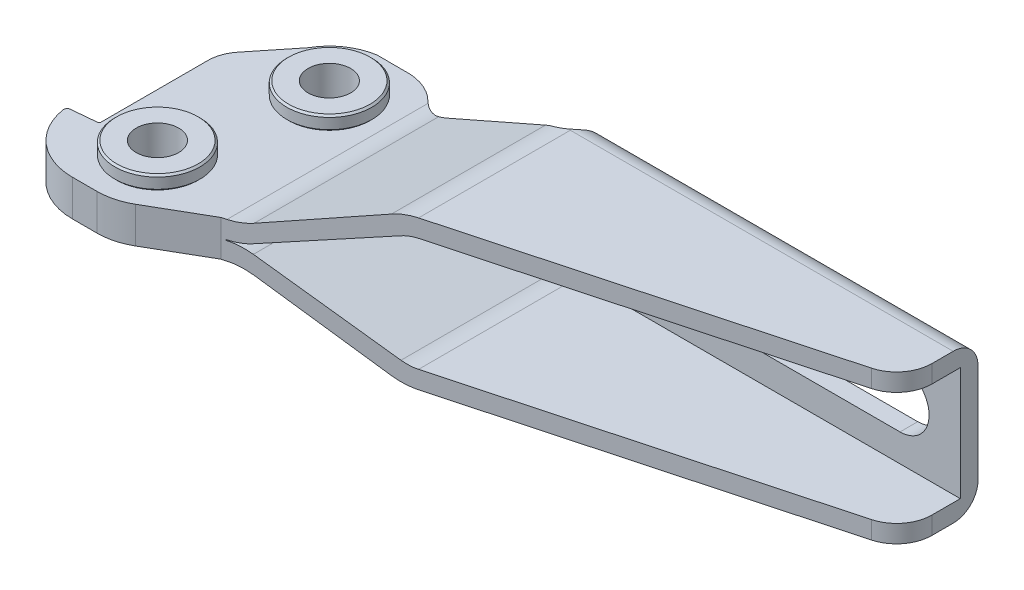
ISO-10303-21;
HEADER;
FILE_DESCRIPTION(('STEP AP214'),'2;1');
FILE_NAME('part.step','',(''),(''),'','','');
FILE_SCHEMA(('AUTOMOTIVE_DESIGN { 1 0 10303 214 1 1 1 1 }'));
ENDSEC;
DATA;
#1=APPLICATION_CONTEXT('core data for automotive mechanical design processes');
#2=APPLICATION_PROTOCOL_DEFINITION('international standard','automotive_design',2000,#1);
#3=PRODUCT_CONTEXT('',#1,'mechanical');
#4=PRODUCT('Part','Part','',(#3));
#5=PRODUCT_RELATED_PRODUCT_CATEGORY('part','',(#4));
#6=PRODUCT_DEFINITION_FORMATION('','',#4);
#7=PRODUCT_DEFINITION_CONTEXT('part definition',#1,'design');
#8=PRODUCT_DEFINITION('design','',#6,#7);
#9=PRODUCT_DEFINITION_SHAPE('','',#8);
#10=(LENGTH_UNIT() NAMED_UNIT(*) SI_UNIT(.MILLI.,.METRE.));
#11=(NAMED_UNIT(*) PLANE_ANGLE_UNIT() SI_UNIT($,.RADIAN.));
#12=(NAMED_UNIT(*) SI_UNIT($,.STERADIAN.) SOLID_ANGLE_UNIT());
#13=UNCERTAINTY_MEASURE_WITH_UNIT(LENGTH_MEASURE(1.E-05),#10,'distance_accuracy_value','');
#14=(GEOMETRIC_REPRESENTATION_CONTEXT(3) GLOBAL_UNCERTAINTY_ASSIGNED_CONTEXT((#13)) GLOBAL_UNIT_ASSIGNED_CONTEXT((#10,
#11,#12)) REPRESENTATION_CONTEXT('',''));
#15=CARTESIAN_POINT('',(0.,0.,0.));
#16=DIRECTION('',(0.,0.,1.));
#17=DIRECTION('',(1.,0.,0.));
#18=AXIS2_PLACEMENT_3D('',#15,#16,#17);
#19=CARTESIAN_POINT('',(0.,-2.55,0.));
#20=DIRECTION('',(0.,-1.,0.));
#21=DIRECTION('',(-0.705253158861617,0.,-0.708955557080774));
#22=AXIS2_PLACEMENT_3D('',#19,#20,#21);
#23=CYLINDRICAL_SURFACE('',#22,6.);
#24=CARTESIAN_POINT('',(0.,-4.3,0.));
#25=DIRECTION('',(0.,-1.,0.));
#26=DIRECTION('',(0.,0.,1.));
#27=AXIS2_PLACEMENT_3D('',#24,#25,#26);
#28=CIRCLE('',#27,6.);
#29=CARTESIAN_POINT('',(0.,-4.3,5.99999999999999));
#30=VERTEX_POINT('',#29);
#31=EDGE_CURVE('E1127',#30,#30,#28,.F.);
#32=ORIENTED_EDGE('',*,*,#31,.T.);
#33=EDGE_LOOP('',(#32));
#34=FACE_BOUND('',#33,.T.);
#35=CARTESIAN_POINT('',(0.,-2.75,0.));
#36=DIRECTION('',(0.,-1.,0.));
#37=DIRECTION('',(-0.705253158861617,0.,-0.708955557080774));
#38=AXIS2_PLACEMENT_3D('',#35,#36,#37);
#39=CIRCLE('',#38,6.);
#40=CARTESIAN_POINT('',(-4.23151895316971,-2.75,-4.25373334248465));
#41=VERTEX_POINT('',#40);
#42=EDGE_CURVE('E1161',#41,#41,#39,.T.);
#43=ORIENTED_EDGE('',*,*,#42,.T.);
#44=EDGE_LOOP('',(#43));
#45=FACE_BOUND('',#44,.T.);
#46=ADVANCED_FACE('F14',(#34,#45),#23,.T.);
#47=CARTESIAN_POINT('',(0.,-4.55,0.));
#48=DIRECTION('',(0.,1.,0.));
#49=DIRECTION('',(0.705253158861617,0.,0.708955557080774));
#50=AXIS2_PLACEMENT_3D('',#47,#48,#49);
#51=CYLINDRICAL_SURFACE('',#50,3.);
#52=CARTESIAN_POINT('',(0.,4.55,0.));
#53=DIRECTION('',(0.,1.,0.));
#54=DIRECTION('',(0.705253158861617,0.,0.708955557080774));
#55=AXIS2_PLACEMENT_3D('',#52,#53,#54);
#56=CIRCLE('',#55,3.);
#57=CARTESIAN_POINT('',(2.11575947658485,4.55,2.12686667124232));
#58=VERTEX_POINT('',#57);
#59=EDGE_CURVE('E363',#58,#58,#56,.T.);
#60=ORIENTED_EDGE('',*,*,#59,.T.);
#61=EDGE_LOOP('',(#60));
#62=FACE_BOUND('',#61,.T.);
#63=CARTESIAN_POINT('',(0.,-4.55,0.));
#64=DIRECTION('',(0.,-1.,0.));
#65=DIRECTION('',(0.,0.,1.));
#66=AXIS2_PLACEMENT_3D('',#63,#64,#65);
#67=CIRCLE('',#66,3.);
#68=CARTESIAN_POINT('',(0.,-4.55,3.));
#69=VERTEX_POINT('',#68);
#70=EDGE_CURVE('E1138',#69,#69,#67,.F.);
#71=ORIENTED_EDGE('',*,*,#70,.F.);
#72=EDGE_LOOP('',(#71));
#73=FACE_BOUND('',#72,.T.);
#74=ADVANCED_FACE('F1067',(#62,#73),#51,.F.);
#75=CARTESIAN_POINT('',(-4.84,-2.55,19.41));
#76=DIRECTION('',(0.,-1.,0.));
#77=DIRECTION('',(-0.705253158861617,0.,-0.708955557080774));
#78=AXIS2_PLACEMENT_3D('',#75,#76,#77);
#79=CYLINDRICAL_SURFACE('',#78,6.);
#80=CARTESIAN_POINT('',(-4.84,-4.3,19.41));
#81=DIRECTION('',(0.,-1.,0.));
#82=DIRECTION('',(1.,0.,0.));
#83=AXIS2_PLACEMENT_3D('',#80,#81,#82);
#84=CIRCLE('',#83,6.);
#85=CARTESIAN_POINT('',(1.16,-4.3,19.41));
#86=VERTEX_POINT('',#85);
#87=EDGE_CURVE('E9',#86,#86,#84,.F.);
#88=ORIENTED_EDGE('',*,*,#87,.T.);
#89=EDGE_LOOP('',(#88));
#90=FACE_BOUND('',#89,.T.);
#91=CARTESIAN_POINT('',(-4.84,-2.75,19.41));
#92=DIRECTION('',(0.,-1.,0.));
#93=DIRECTION('',(-0.705253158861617,0.,-0.708955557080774));
#94=AXIS2_PLACEMENT_3D('',#91,#92,#93);
#95=CIRCLE('',#94,6.);
#96=CARTESIAN_POINT('',(-9.0715189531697,-2.75,15.1562666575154));
#97=VERTEX_POINT('',#96);
#98=EDGE_CURVE('E1152',#97,#97,#95,.T.);
#99=ORIENTED_EDGE('',*,*,#98,.T.);
#100=EDGE_LOOP('',(#99));
#101=FACE_BOUND('',#100,.T.);
#102=ADVANCED_FACE('F1074',(#90,#101),#79,.T.);
#103=CARTESIAN_POINT('',(-4.84,-4.55,19.41));
#104=DIRECTION('',(0.,1.,0.));
#105=DIRECTION('',(0.705253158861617,0.,0.708955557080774));
#106=AXIS2_PLACEMENT_3D('',#103,#104,#105);
#107=CYLINDRICAL_SURFACE('',#106,3.);
#108=CARTESIAN_POINT('',(-4.84,4.55,19.41));
#109=DIRECTION('',(0.,1.,0.));
#110=DIRECTION('',(0.705253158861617,0.,0.708955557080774));
#111=AXIS2_PLACEMENT_3D('',#108,#109,#110);
#112=CIRCLE('',#111,3.);
#113=CARTESIAN_POINT('',(-2.72424052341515,4.55,21.5368666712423));
#114=VERTEX_POINT('',#113);
#115=EDGE_CURVE('E1158',#114,#114,#112,.T.);
#116=ORIENTED_EDGE('',*,*,#115,.T.);
#117=EDGE_LOOP('',(#116));
#118=FACE_BOUND('',#117,.T.);
#119=CARTESIAN_POINT('',(-4.84,-4.55,19.41));
#120=DIRECTION('',(0.,-1.,0.));
#121=DIRECTION('',(0.,0.,1.));
#122=AXIS2_PLACEMENT_3D('',#119,#120,#121);
#123=CIRCLE('',#122,3.);
#124=CARTESIAN_POINT('',(-4.84,-4.55,22.41));
#125=VERTEX_POINT('',#124);
#126=EDGE_CURVE('E1150',#125,#125,#123,.F.);
#127=ORIENTED_EDGE('',*,*,#126,.F.);
#128=EDGE_LOOP('',(#127));
#129=FACE_BOUND('',#128,.T.);
#130=ADVANCED_FACE('F1101',(#118,#129),#107,.F.);
#131=CARTESIAN_POINT('',(-4.84,-2.55,19.41));
#132=DIRECTION('',(0.,-1.,0.));
#133=DIRECTION('',(-0.705253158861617,0.,-0.708955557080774));
#134=AXIS2_PLACEMENT_3D('',#131,#132,#133);
#135=CONICAL_SURFACE('',#134,5.8,0.785398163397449);
#136=ORIENTED_EDGE('',*,*,#98,.F.);
#137=EDGE_LOOP('',(#136));
#138=FACE_BOUND('',#137,.T.);
#139=CARTESIAN_POINT('',(-4.84,-2.55,19.41));
#140=DIRECTION('',(0.,-1.,0.));
#141=DIRECTION('',(0.,0.,1.));
#142=AXIS2_PLACEMENT_3D('',#139,#140,#141);
#143=CIRCLE('',#142,5.8);
#144=CARTESIAN_POINT('',(-4.84,-2.55,25.21));
#145=VERTEX_POINT('',#144);
#146=EDGE_CURVE('E850',#145,#145,#143,.F.);
#147=ORIENTED_EDGE('',*,*,#146,.F.);
#148=EDGE_LOOP('',(#147));
#149=FACE_BOUND('',#148,.T.);
#150=ADVANCED_FACE('F1099',(#138,#149),#135,.T.);
#151=CARTESIAN_POINT('',(-4.84,2.55,19.41));
#152=DIRECTION('',(0.,1.,0.));
#153=DIRECTION('',(0.705253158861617,0.,0.708955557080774));
#154=AXIS2_PLACEMENT_3D('',#151,#152,#153);
#155=CONICAL_SURFACE('',#154,5.75,0.785398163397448);
#156=CARTESIAN_POINT('',(-4.84,2.8,19.41));
#157=DIRECTION('',(0.,1.,0.));
#158=DIRECTION('',(0.705253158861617,0.,0.708955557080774));
#159=AXIS2_PLACEMENT_3D('',#156,#157,#158);
#160=CIRCLE('',#159,6.);
#161=CARTESIAN_POINT('',(-0.608481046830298,2.8,23.6637333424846));
#162=VERTEX_POINT('',#161);
#163=EDGE_CURVE('E1162',#162,#162,#160,.T.);
#164=ORIENTED_EDGE('',*,*,#163,.F.);
#165=EDGE_LOOP('',(#164));
#166=FACE_BOUND('',#165,.T.);
#167=CARTESIAN_POINT('',(-4.84,2.55,19.41));
#168=DIRECTION('',(0.,1.,0.));
#169=DIRECTION('',(0.,0.,-1.));
#170=AXIS2_PLACEMENT_3D('',#167,#168,#169);
#171=CIRCLE('',#170,5.75);
#172=CARTESIAN_POINT('',(-4.84,2.55,13.66));
#173=VERTEX_POINT('',#172);
#174=EDGE_CURVE('E1135',#173,#173,#171,.F.);
#175=ORIENTED_EDGE('',*,*,#174,.F.);
#176=EDGE_LOOP('',(#175));
#177=FACE_BOUND('',#176,.T.);
#178=ADVANCED_FACE('F1095',(#166,#177),#155,.T.);
#179=CARTESIAN_POINT('',(-4.84,-4.55,19.41));
#180=DIRECTION('',(0.,1.,0.));
#181=DIRECTION('',(0.705253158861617,0.,0.708955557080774));
#182=AXIS2_PLACEMENT_3D('',#179,#180,#181);
#183=CYLINDRICAL_SURFACE('',#182,6.);
#184=CARTESIAN_POINT('',(-4.84,4.3,19.41));
#185=DIRECTION('',(0.,1.,0.));
#186=DIRECTION('',(0.705253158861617,0.,0.708955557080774));
#187=AXIS2_PLACEMENT_3D('',#184,#185,#186);
#188=CIRCLE('',#187,6.);
#189=CARTESIAN_POINT('',(-0.608481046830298,4.3,23.6637333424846));
#190=VERTEX_POINT('',#189);
#191=EDGE_CURVE('E1165',#190,#190,#188,.T.);
#192=ORIENTED_EDGE('',*,*,#191,.F.);
#193=EDGE_LOOP('',(#192));
#194=FACE_BOUND('',#193,.T.);
#195=ORIENTED_EDGE('',*,*,#163,.T.);
#196=EDGE_LOOP('',(#195));
#197=FACE_BOUND('',#196,.T.);
#198=ADVANCED_FACE('F1091',(#194,#197),#183,.T.);
#199=CARTESIAN_POINT('',(-4.84,4.3,19.41));
#200=DIRECTION('',(0.,-1.,0.));
#201=DIRECTION('',(-0.705253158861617,0.,-0.708955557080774));
#202=AXIS2_PLACEMENT_3D('',#199,#200,#201);
#203=CONICAL_SURFACE('',#202,6.,0.785398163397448);
#204=CARTESIAN_POINT('',(-4.84,4.55,19.41));
#205=DIRECTION('',(0.,1.,0.));
#206=DIRECTION('',(0.705253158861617,0.,0.708955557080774));
#207=AXIS2_PLACEMENT_3D('',#204,#205,#206);
#208=CIRCLE('',#207,5.75);
#209=CARTESIAN_POINT('',(-0.784794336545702,4.55,23.4864944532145));
#210=VERTEX_POINT('',#209);
#211=EDGE_CURVE('E1154',#210,#210,#208,.T.);
#212=ORIENTED_EDGE('',*,*,#211,.F.);
#213=EDGE_LOOP('',(#212));
#214=FACE_BOUND('',#213,.T.);
#215=ORIENTED_EDGE('',*,*,#191,.T.);
#216=EDGE_LOOP('',(#215));
#217=FACE_BOUND('',#216,.T.);
#218=ADVANCED_FACE('F499',(#214,#217),#203,.T.);
#219=CARTESIAN_POINT('',(-0.763505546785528,4.55,15.3547943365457));
#220=DIRECTION('',(0.,-1.,0.));
#221=DIRECTION('',(-0.705253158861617,0.,-0.708955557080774));
#222=AXIS2_PLACEMENT_3D('',#219,#220,#221);
#223=PLANE('',#222);
#224=ORIENTED_EDGE('',*,*,#115,.F.);
#225=EDGE_LOOP('',(#224));
#226=FACE_BOUND('',#225,.T.);
#227=ORIENTED_EDGE('',*,*,#211,.T.);
#228=EDGE_LOOP('',(#227));
#229=FACE_BOUND('',#228,.T.);
#230=ADVANCED_FACE('F1086',(#226,#229),#223,.F.);
#231=CARTESIAN_POINT('',(0.,-2.55,0.));
#232=DIRECTION('',(0.,-1.,0.));
#233=DIRECTION('',(-0.705253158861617,0.,-0.708955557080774));
#234=AXIS2_PLACEMENT_3D('',#231,#232,#233);
#235=CONICAL_SURFACE('',#234,5.8,0.785398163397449);
#236=ORIENTED_EDGE('',*,*,#42,.F.);
#237=EDGE_LOOP('',(#236));
#238=FACE_BOUND('',#237,.T.);
#239=CARTESIAN_POINT('',(0.,-2.55,0.));
#240=DIRECTION('',(0.,-1.,0.));
#241=DIRECTION('',(0.,0.,1.));
#242=AXIS2_PLACEMENT_3D('',#239,#240,#241);
#243=CIRCLE('',#242,5.8);
#244=CARTESIAN_POINT('',(0.,-2.55,5.79999999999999));
#245=VERTEX_POINT('',#244);
#246=EDGE_CURVE('E1184',#245,#245,#243,.F.);
#247=ORIENTED_EDGE('',*,*,#246,.F.);
#248=EDGE_LOOP('',(#247));
#249=FACE_BOUND('',#248,.T.);
#250=ADVANCED_FACE('F1082',(#238,#249),#235,.T.);
#251=CARTESIAN_POINT('',(0.,2.55,0.));
#252=DIRECTION('',(0.,1.,0.));
#253=DIRECTION('',(0.705253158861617,0.,0.708955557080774));
#254=AXIS2_PLACEMENT_3D('',#251,#252,#253);
#255=CONICAL_SURFACE('',#254,5.75,0.785398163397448);
#256=CARTESIAN_POINT('',(0.,2.8,0.));
#257=DIRECTION('',(0.,1.,0.));
#258=DIRECTION('',(0.705253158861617,0.,0.708955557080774));
#259=AXIS2_PLACEMENT_3D('',#256,#257,#258);
#260=CIRCLE('',#259,6.);
#261=CARTESIAN_POINT('',(4.2315189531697,2.8,4.25373334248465));
#262=VERTEX_POINT('',#261);
#263=EDGE_CURVE('E1175',#262,#262,#260,.T.);
#264=ORIENTED_EDGE('',*,*,#263,.F.);
#265=EDGE_LOOP('',(#264));
#266=FACE_BOUND('',#265,.T.);
#267=CARTESIAN_POINT('',(0.,2.55,0.));
#268=DIRECTION('',(0.,1.,0.));
#269=DIRECTION('',(0.,0.,-1.));
#270=AXIS2_PLACEMENT_3D('',#267,#268,#269);
#271=CIRCLE('',#270,5.75);
#272=CARTESIAN_POINT('',(0.,2.55,-5.75));
#273=VERTEX_POINT('',#272);
#274=EDGE_CURVE('E1131',#273,#273,#271,.F.);
#275=ORIENTED_EDGE('',*,*,#274,.F.);
#276=EDGE_LOOP('',(#275));
#277=FACE_BOUND('',#276,.T.);
#278=ADVANCED_FACE('F1085',(#266,#277),#255,.T.);
#279=CARTESIAN_POINT('',(0.,-4.55,0.));
#280=DIRECTION('',(0.,1.,0.));
#281=DIRECTION('',(0.705253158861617,0.,0.708955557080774));
#282=AXIS2_PLACEMENT_3D('',#279,#280,#281);
#283=CYLINDRICAL_SURFACE('',#282,6.);
#284=CARTESIAN_POINT('',(0.,4.3,0.));
#285=DIRECTION('',(0.,1.,0.));
#286=DIRECTION('',(0.705253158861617,0.,0.708955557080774));
#287=AXIS2_PLACEMENT_3D('',#284,#285,#286);
#288=CIRCLE('',#287,6.);
#289=CARTESIAN_POINT('',(4.2315189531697,4.3,4.25373334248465));
#290=VERTEX_POINT('',#289);
#291=EDGE_CURVE('E1178',#290,#290,#288,.T.);
#292=ORIENTED_EDGE('',*,*,#291,.F.);
#293=EDGE_LOOP('',(#292));
#294=FACE_BOUND('',#293,.T.);
#295=ORIENTED_EDGE('',*,*,#263,.T.);
#296=EDGE_LOOP('',(#295));
#297=FACE_BOUND('',#296,.T.);
#298=ADVANCED_FACE('F1198',(#294,#297),#283,.T.);
#299=CARTESIAN_POINT('',(0.,4.3,0.));
#300=DIRECTION('',(0.,-1.,0.));
#301=DIRECTION('',(-0.705253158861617,0.,-0.708955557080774));
#302=AXIS2_PLACEMENT_3D('',#299,#300,#301);
#303=CONICAL_SURFACE('',#302,6.,0.785398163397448);
#304=CARTESIAN_POINT('',(0.,4.55,0.));
#305=DIRECTION('',(0.,1.,0.));
#306=DIRECTION('',(0.705253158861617,0.,0.708955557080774));
#307=AXIS2_PLACEMENT_3D('',#304,#305,#306);
#308=CIRCLE('',#307,5.75);
#309=CARTESIAN_POINT('',(4.0552056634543,4.55,4.07649445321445));
#310=VERTEX_POINT('',#309);
#311=EDGE_CURVE('E1172',#310,#310,#308,.T.);
#312=ORIENTED_EDGE('',*,*,#311,.F.);
#313=EDGE_LOOP('',(#312));
#314=FACE_BOUND('',#313,.T.);
#315=ORIENTED_EDGE('',*,*,#291,.T.);
#316=EDGE_LOOP('',(#315));
#317=FACE_BOUND('',#316,.T.);
#318=ADVANCED_FACE('F1147',(#314,#317),#303,.T.);
#319=CARTESIAN_POINT('',(4.07649445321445,4.55,-4.0552056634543));
#320=DIRECTION('',(0.,-1.,0.));
#321=DIRECTION('',(-0.705253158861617,0.,-0.708955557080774));
#322=AXIS2_PLACEMENT_3D('',#319,#320,#321);
#323=PLANE('',#322);
#324=ORIENTED_EDGE('',*,*,#59,.F.);
#325=EDGE_LOOP('',(#324));
#326=FACE_BOUND('',#325,.T.);
#327=ORIENTED_EDGE('',*,*,#311,.T.);
#328=EDGE_LOOP('',(#327));
#329=FACE_BOUND('',#328,.T.);
#330=ADVANCED_FACE('F1081',(#326,#329),#323,.F.);
#331=CARTESIAN_POINT('',(37.5,0.,-11.98));
#332=DIRECTION('',(0.,0.,1.));
#333=DIRECTION('',(0.,1.,0.));
#334=AXIS2_PLACEMENT_3D('',#331,#332,#333);
#335=CYLINDRICAL_SURFACE('',#334,4.1);
#336=CARTESIAN_POINT('',(37.5,0.,-8.49));
#337=DIRECTION('',(0.,0.,-1.));
#338=DIRECTION('',(0.,-1.,0.));
#339=AXIS2_PLACEMENT_3D('',#336,#337,#338);
#340=CIRCLE('',#339,4.1);
#341=CARTESIAN_POINT('',(37.5,-4.1,-8.49));
#342=VERTEX_POINT('',#341);
#343=CARTESIAN_POINT('',(37.5,4.1,-8.49));
#344=VERTEX_POINT('',#343);
#345=EDGE_CURVE('E354',#342,#344,#340,.T.);
#346=ORIENTED_EDGE('',*,*,#345,.T.);
#347=DIRECTION('',(0.,0.,1.));
#348=VECTOR('',#347,1.);
#349=CARTESIAN_POINT('',(37.5,4.1,-11.98));
#350=LINE('',#349,#348);
#351=CARTESIAN_POINT('',(37.5,4.1,-5.99));
#352=VERTEX_POINT('',#351);
#353=EDGE_CURVE('E378',#344,#352,#350,.T.);
#354=ORIENTED_EDGE('',*,*,#353,.T.);
#355=CARTESIAN_POINT('',(37.5,0.,-5.99));
#356=DIRECTION('',(0.,0.,1.));
#357=DIRECTION('',(1.,0.,0.));
#358=AXIS2_PLACEMENT_3D('',#355,#356,#357);
#359=CIRCLE('',#358,4.1);
#360=CARTESIAN_POINT('',(37.5,-4.1,-5.99));
#361=VERTEX_POINT('',#360);
#362=EDGE_CURVE('E372',#352,#361,#359,.T.);
#363=ORIENTED_EDGE('',*,*,#362,.T.);
#364=DIRECTION('',(0.,0.,1.));
#365=VECTOR('',#364,1.);
#366=CARTESIAN_POINT('',(37.5,-4.1,-11.98));
#367=LINE('',#366,#365);
#368=EDGE_CURVE('E29',#342,#361,#367,.T.);
#369=ORIENTED_EDGE('',*,*,#368,.F.);
#370=EDGE_LOOP('',(#346,#354,#363,#369));
#371=FACE_BOUND('',#370,.T.);
#372=ADVANCED_FACE('F1088',(#371),#335,.F.);
#373=CARTESIAN_POINT('',(74.5,4.1,-11.98));
#374=DIRECTION('',(0.,1.,0.));
#375=DIRECTION('',(-1.,0.,0.));
#376=AXIS2_PLACEMENT_3D('',#373,#374,#375);
#377=PLANE('',#376);
#378=DIRECTION('',(1.,0.,0.));
#379=VECTOR('',#378,1.);
#380=CARTESIAN_POINT('',(83.,4.1,-8.49));
#381=LINE('',#380,#379);
#382=CARTESIAN_POINT('',(74.5,4.1,-8.49));
#383=VERTEX_POINT('',#382);
#384=EDGE_CURVE('E382',#344,#383,#381,.T.);
#385=ORIENTED_EDGE('',*,*,#384,.T.);
#386=DIRECTION('',(0.,0.,1.));
#387=VECTOR('',#386,1.);
#388=CARTESIAN_POINT('',(74.5,4.1,-11.98));
#389=LINE('',#388,#387);
#390=CARTESIAN_POINT('',(74.5,4.1,-5.99));
#391=VERTEX_POINT('',#390);
#392=EDGE_CURVE('E355',#383,#391,#389,.T.);
#393=ORIENTED_EDGE('',*,*,#392,.T.);
#394=DIRECTION('',(-1.,0.,0.));
#395=VECTOR('',#394,1.);
#396=CARTESIAN_POINT('',(74.5,4.1,-5.99));
#397=LINE('',#396,#395);
#398=EDGE_CURVE('E37',#391,#352,#397,.T.);
#399=ORIENTED_EDGE('',*,*,#398,.T.);
#400=ORIENTED_EDGE('',*,*,#353,.F.);
#401=EDGE_LOOP('',(#385,#393,#399,#400));
#402=FACE_BOUND('',#401,.T.);
#403=ADVANCED_FACE('F1220',(#402),#377,.F.);
#404=CARTESIAN_POINT('',(74.5,0.,-11.98));
#405=DIRECTION('',(0.,0.,1.));
#406=DIRECTION('',(0.,1.,0.));
#407=AXIS2_PLACEMENT_3D('',#404,#405,#406);
#408=CYLINDRICAL_SURFACE('',#407,4.1);
#409=CARTESIAN_POINT('',(74.5,0.,-8.49));
#410=DIRECTION('',(0.,0.,-1.));
#411=DIRECTION('',(0.,-1.,0.));
#412=AXIS2_PLACEMENT_3D('',#409,#410,#411);
#413=CIRCLE('',#412,4.1);
#414=CARTESIAN_POINT('',(74.5,-4.1,-8.49));
#415=VERTEX_POINT('',#414);
#416=EDGE_CURVE('E351',#383,#415,#413,.T.);
#417=ORIENTED_EDGE('',*,*,#416,.T.);
#418=DIRECTION('',(0.,0.,1.));
#419=VECTOR('',#418,1.);
#420=CARTESIAN_POINT('',(74.5,-4.1,-11.98));
#421=LINE('',#420,#419);
#422=CARTESIAN_POINT('',(74.5,-4.1,-5.99));
#423=VERTEX_POINT('',#422);
#424=EDGE_CURVE('E344',#415,#423,#421,.T.);
#425=ORIENTED_EDGE('',*,*,#424,.T.);
#426=CARTESIAN_POINT('',(74.5,0.,-5.99));
#427=DIRECTION('',(0.,0.,1.));
#428=DIRECTION('',(-1.,0.,0.));
#429=AXIS2_PLACEMENT_3D('',#426,#427,#428);
#430=CIRCLE('',#429,4.1);
#431=EDGE_CURVE('E349',#423,#391,#430,.T.);
#432=ORIENTED_EDGE('',*,*,#431,.T.);
#433=ORIENTED_EDGE('',*,*,#392,.F.);
#434=EDGE_LOOP('',(#417,#425,#432,#433));
#435=FACE_BOUND('',#434,.T.);
#436=ADVANCED_FACE('F346',(#435),#408,.F.);
#437=CARTESIAN_POINT('',(37.5,-4.1,-11.98));
#438=DIRECTION('',(0.,-1.,0.));
#439=DIRECTION('',(1.,0.,0.));
#440=AXIS2_PLACEMENT_3D('',#437,#438,#439);
#441=PLANE('',#440);
#442=DIRECTION('',(-1.,0.,0.));
#443=VECTOR('',#442,1.);
#444=CARTESIAN_POINT('',(83.,-4.1,-8.49));
#445=LINE('',#444,#443);
#446=EDGE_CURVE('E385',#415,#342,#445,.T.);
#447=ORIENTED_EDGE('',*,*,#446,.T.);
#448=ORIENTED_EDGE('',*,*,#368,.T.);
#449=DIRECTION('',(1.,0.,0.));
#450=VECTOR('',#449,1.);
#451=CARTESIAN_POINT('',(37.5,-4.1,-5.99));
#452=LINE('',#451,#450);
#453=EDGE_CURVE('E358',#361,#423,#452,.T.);
#454=ORIENTED_EDGE('',*,*,#453,.T.);
#455=ORIENTED_EDGE('',*,*,#424,.F.);
#456=EDGE_LOOP('',(#447,#448,#454,#455));
#457=FACE_BOUND('',#456,.T.);
#458=ADVANCED_FACE('F359',(#457),#441,.F.);
#459=CARTESIAN_POINT('',(83.,-7.,-4.99));
#460=DIRECTION('',(-1.,0.,0.));
#461=DIRECTION('',(0.,-1.,0.));
#462=AXIS2_PLACEMENT_3D('',#459,#460,#461);
#463=CYLINDRICAL_SURFACE('',#462,3.50000000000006);
#464=CARTESIAN_POINT('',(30.,-7.,-4.99));
#465=DIRECTION('',(-1.,0.,0.));
#466=DIRECTION('',(0.,-1.,0.));
#467=AXIS2_PLACEMENT_3D('',#464,#465,#466);
#468=CIRCLE('',#467,3.50000000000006);
#469=CARTESIAN_POINT('',(30.,-9.4392416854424,-7.5));
#470=VERTEX_POINT('',#469);
#471=CARTESIAN_POINT('',(30.,-7.,-8.49));
#472=VERTEX_POINT('',#471);
#473=EDGE_CURVE('E866',#470,#472,#468,.F.);
#474=ORIENTED_EDGE('',*,*,#473,.T.);
#475=DIRECTION('',(-1.,0.,0.));
#476=VECTOR('',#475,1.);
#477=CARTESIAN_POINT('',(83.,-7.,-8.49));
#478=LINE('',#477,#476);
#479=CARTESIAN_POINT('',(83.,-7.,-8.49));
#480=VERTEX_POINT('',#479);
#481=EDGE_CURVE('E402',#480,#472,#478,.T.);
#482=ORIENTED_EDGE('',*,*,#481,.F.);
#483=CARTESIAN_POINT('',(83.,-7.,-4.99));
#484=DIRECTION('',(1.,0.,0.));
#485=DIRECTION('',(0.,0.,1.));
#486=AXIS2_PLACEMENT_3D('',#483,#484,#485);
#487=CIRCLE('',#486,3.50000000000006);
#488=CARTESIAN_POINT('',(83.,-10.5,-4.99));
#489=VERTEX_POINT('',#488);
#490=EDGE_CURVE('E391',#489,#480,#487,.T.);
#491=ORIENTED_EDGE('',*,*,#490,.F.);
#492=DIRECTION('',(-1.,0.,0.));
#493=VECTOR('',#492,1.);
#494=CARTESIAN_POINT('',(83.,-10.5,-4.99));
#495=LINE('',#494,#493);
#496=CARTESIAN_POINT('',(29.,-10.5,-4.99));
#497=VERTEX_POINT('',#496);
#498=EDGE_CURVE('E405',#489,#497,#495,.T.);
#499=ORIENTED_EDGE('',*,*,#498,.T.);
#500=CARTESIAN_POINT('',(28.4008648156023,-10.4760308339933,-5.39891275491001));
#501=CARTESIAN_POINT('',(28.5957571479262,-10.4916291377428,-5.26602255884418));
#502=CARTESIAN_POINT('',(28.7907015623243,-10.4996143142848,-5.13297500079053));
#503=CARTESIAN_POINT('',(28.9904653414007,-10.4999954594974,-4.99651348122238));
#504=CARTESIAN_POINT('',(28.9952326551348,-10.5000000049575,-4.99325678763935));
#505=CARTESIAN_POINT('',(28.9999999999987,-10.5,-4.99));
#506=B_SPLINE_CURVE_WITH_KNOTS('',3,(#500,#501,#502,#503,#504,#505),.UNSPECIFIED.,.F.,.F.,(4,2,
4),(0.,0.708462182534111,0.725782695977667),.UNSPECIFIED.);
#507=CARTESIAN_POINT('',(28.8184935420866,-10.4978033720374,-5.11398213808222));
#508=VERTEX_POINT('',#507);
#509=EDGE_CURVE('E844',#497,#508,#506,.F.);
#510=ORIENTED_EDGE('',*,*,#509,.T.);
#511=CARTESIAN_POINT('',(28.6431372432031,-10.5,-4.99));
#512=CARTESIAN_POINT('',(28.7052951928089,-10.4999975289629,-5.03067999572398));
#513=CARTESIAN_POINT('',(28.7659421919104,-10.4992907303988,-5.07369013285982));
#514=CARTESIAN_POINT('',(28.8838776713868,-10.4959614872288,-5.16408192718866));
#515=CARTESIAN_POINT('',(28.9411643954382,-10.4933380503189,-5.21146583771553));
#516=CARTESIAN_POINT('',(29.05218246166,-10.4856533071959,-5.31045634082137));
#517=CARTESIAN_POINT('',(29.1058998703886,-10.4805830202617,-5.36207790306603));
#518=CARTESIAN_POINT('',(29.2091713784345,-10.4674898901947,-5.46897017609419));
#519=CARTESIAN_POINT('',(29.2587262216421,-10.4594675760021,-5.52424023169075));
#520=CARTESIAN_POINT('',(29.3535458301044,-10.4399425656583,-5.63818936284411));
#521=CARTESIAN_POINT('',(29.3987909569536,-10.4284248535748,-5.69688224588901));
#522=CARTESIAN_POINT('',(29.4844374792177,-10.401485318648,-5.81684753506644));
#523=CARTESIAN_POINT('',(29.5248392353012,-10.3860637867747,-5.87811974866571));
#524=CARTESIAN_POINT('',(29.6004589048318,-10.3510070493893,-6.00237403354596));
#525=CARTESIAN_POINT('',(29.6356917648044,-10.3313844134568,-6.06535052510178));
#526=CARTESIAN_POINT('',(29.700979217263,-10.2876684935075,-6.1923980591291));
#527=CARTESIAN_POINT('',(29.7310342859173,-10.2635756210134,-6.2564690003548));
#528=CARTESIAN_POINT('',(29.809487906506,-10.1881006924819,-6.44002539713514));
#529=CARTESIAN_POINT('',(29.8515524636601,-10.1310185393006,-6.55997631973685));
#530=CARTESIAN_POINT('',(29.9188668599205,-10.0009998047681,-6.79616811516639));
#531=CARTESIAN_POINT('',(29.9440804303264,-9.92802947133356,-6.91240047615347));
#532=CARTESIAN_POINT('',(29.975707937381,-9.78729285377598,-7.10940703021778));
#533=CARTESIAN_POINT('',(29.9852048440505,-9.72258702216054,-7.19192286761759));
#534=CARTESIAN_POINT('',(29.9973417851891,-9.58607509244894,-7.35076341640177));
#535=CARTESIAN_POINT('',(30.000012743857,-9.51430255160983,-7.42711452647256));
#536=CARTESIAN_POINT('',(30.,-9.4392416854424,-7.5));
#537=B_SPLINE_CURVE_WITH_KNOTS('',3,(#511,#512,#513,#514,#515,#516,#517,#518,#519,#520,#521,
#522,#523,#524,#525,#526,#527,#528,#529,#530,#531,#532,#533,#534,#535,#536),.UNSPECIFIED.,.F.,
.F.,(4,2,2,2,2,2,2,2,2,2,2,2,4),(0.,0.22282276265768,0.445760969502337,0.669523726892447,
0.893246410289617,1.1179441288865,1.3426251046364,1.56664300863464,1.79064030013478,
2.2064711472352,2.62319413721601,2.938430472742,3.25223611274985),.UNSPECIFIED.);
#538=EDGE_CURVE('E859',#508,#470,#537,.T.);
#539=ORIENTED_EDGE('',*,*,#538,.T.);
#540=EDGE_LOOP('',(#474,#482,#491,#499,#510,#539));
#541=FACE_BOUND('',#540,.T.);
#542=ADVANCED_FACE('F853',(#541),#463,.T.);
#543=CARTESIAN_POINT('',(83.,-7.,-8.49));
#544=DIRECTION('',(0.,0.,1.));
#545=DIRECTION('',(0.,1.,0.));
#546=AXIS2_PLACEMENT_3D('',#543,#544,#545);
#547=PLANE('',#546);
#548=DIRECTION('',(-1.,0.,0.));
#549=VECTOR('',#548,1.);
#550=CARTESIAN_POINT('',(7.73,-2.55,-8.49));
#551=LINE('',#550,#549);
#552=CARTESIAN_POINT('',(2.87403208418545,-2.55,-8.49));
#553=VERTEX_POINT('',#552);
#554=CARTESIAN_POINT('',(0.,-2.55,-8.49));
#555=VERTEX_POINT('',#554);
#556=EDGE_CURVE('E867',#553,#555,#551,.T.);
#557=ORIENTED_EDGE('',*,*,#556,.T.);
#558=DIRECTION('',(0.,1.,0.));
#559=VECTOR('',#558,1.);
#560=CARTESIAN_POINT('',(0.,-7.,-8.49));
#561=LINE('',#560,#559);
#562=CARTESIAN_POINT('',(0.,2.55,-8.49));
#563=VERTEX_POINT('',#562);
#564=EDGE_CURVE('E387',#555,#563,#561,.T.);
#565=ORIENTED_EDGE('',*,*,#564,.T.);
#566=DIRECTION('',(1.,0.,0.));
#567=VECTOR('',#566,1.);
#568=CARTESIAN_POINT('',(-19.34,2.55,-8.49));
#569=LINE('',#568,#567);
#570=CARTESIAN_POINT('',(2.87403208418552,2.55,-8.49));
#571=VERTEX_POINT('',#570);
#572=EDGE_CURVE('E851',#563,#571,#569,.T.);
#573=ORIENTED_EDGE('',*,*,#572,.T.);
#574=DIRECTION('',(0.,1.,0.));
#575=VECTOR('',#574,1.);
#576=CARTESIAN_POINT('',(2.87403208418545,-10.5,-8.49));
#577=LINE('',#576,#575);
#578=EDGE_CURVE('E967',#571,#553,#577,.F.);
#579=ORIENTED_EDGE('',*,*,#578,.T.);
#580=EDGE_LOOP('',(#557,#565,#573,#579));
#581=FACE_BOUND('',#580,.T.);
#582=ADVANCED_FACE('F430',(#581),#547,.F.);
#583=CARTESIAN_POINT('',(0.,-7.,-4.99));
#584=DIRECTION('',(1.,0.,0.));
#585=DIRECTION('',(0.,0.,-1.));
#586=AXIS2_PLACEMENT_3D('',#583,#584,#585);
#587=PLANE('',#586);
#588=DIRECTION('',(0.,-1.,0.));
#589=VECTOR('',#588,1.);
#590=CARTESIAN_POINT('',(0.,-10.5,-8.5));
#591=LINE('',#590,#589);
#592=CARTESIAN_POINT('',(0.,2.55,-8.5));
#593=VERTEX_POINT('',#592);
#594=CARTESIAN_POINT('',(0.,-2.55,-8.5));
#595=VERTEX_POINT('',#594);
#596=EDGE_CURVE('E960',#593,#595,#591,.T.);
#597=ORIENTED_EDGE('',*,*,#596,.F.);
#598=DIRECTION('',(0.,0.,-1.));
#599=VECTOR('',#598,1.);
#600=CARTESIAN_POINT('',(0.,2.55,29.91));
#601=LINE('',#600,#599);
#602=EDGE_CURVE('E442',#563,#593,#601,.T.);
#603=ORIENTED_EDGE('',*,*,#602,.F.);
#604=ORIENTED_EDGE('',*,*,#564,.F.);
#605=DIRECTION('',(0.,0.,1.));
#606=VECTOR('',#605,1.);
#607=CARTESIAN_POINT('',(0.,-2.55,29.91));
#608=LINE('',#607,#606);
#609=EDGE_CURVE('E962',#595,#555,#608,.T.);
#610=ORIENTED_EDGE('',*,*,#609,.F.);
#611=EDGE_LOOP('',(#597,#603,#604,#610));
#612=FACE_BOUND('',#611,.T.);
#613=ADVANCED_FACE('F427',(#612),#587,.T.);
#614=CARTESIAN_POINT('',(83.,7.,-4.99));
#615=DIRECTION('',(-1.,0.,0.));
#616=DIRECTION('',(0.,-1.,0.));
#617=AXIS2_PLACEMENT_3D('',#614,#615,#616);
#618=CYLINDRICAL_SURFACE('',#617,3.50000000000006);
#619=CARTESIAN_POINT('',(30.,7.,-4.99));
#620=DIRECTION('',(-1.,0.,0.));
#621=DIRECTION('',(0.,-1.,0.));
#622=AXIS2_PLACEMENT_3D('',#619,#620,#621);
#623=CIRCLE('',#622,3.50000000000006);
#624=CARTESIAN_POINT('',(30.,7.,-8.49));
#625=VERTEX_POINT('',#624);
#626=CARTESIAN_POINT('',(30.,9.43924168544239,-7.5));
#627=VERTEX_POINT('',#626);
#628=EDGE_CURVE('E415',#625,#627,#623,.F.);
#629=ORIENTED_EDGE('',*,*,#628,.T.);
#630=CARTESIAN_POINT('',(30.,9.43924168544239,-7.5));
#631=CARTESIAN_POINT('',(30.0000030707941,9.49237837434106,-7.44837682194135));
#632=CARTESIAN_POINT('',(29.9986673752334,9.54387595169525,-7.39503594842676));
#633=CARTESIAN_POINT('',(29.9928088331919,9.64334391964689,-7.28525659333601));
#634=CARTESIAN_POINT('',(29.988283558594,9.69131159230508,-7.22881578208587));
#635=CARTESIAN_POINT('',(29.9755144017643,9.78353542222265,-7.11307030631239));
#636=CARTESIAN_POINT('',(29.9672587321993,9.82777928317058,-7.05375710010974));
#637=CARTESIAN_POINT('',(29.9465600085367,9.9121022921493,-6.93295720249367));
#638=CARTESIAN_POINT('',(29.9341180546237,9.95218253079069,-6.87147108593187));
#639=CARTESIAN_POINT('',(29.9045625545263,10.0281730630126,-6.74657057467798));
#640=CARTESIAN_POINT('',(29.8874237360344,10.0640592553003,-6.68314744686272));
#641=CARTESIAN_POINT('',(29.8481950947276,10.1312452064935,-6.55541091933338));
#642=CARTESIAN_POINT('',(29.8261056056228,10.1625452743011,-6.4910975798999));
#643=CARTESIAN_POINT('',(29.7768456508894,10.2204238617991,-6.36252470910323));
#644=CARTESIAN_POINT('',(29.7496894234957,10.2470152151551,-6.29826552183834));
#645=CARTESIAN_POINT('',(29.6902153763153,10.295639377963,-6.1704431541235));
#646=CARTESIAN_POINT('',(29.6578980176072,10.3176725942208,-6.10687991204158));
#647=CARTESIAN_POINT('',(29.5586621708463,10.3741093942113,-5.92813834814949));
#648=CARTESIAN_POINT('',(29.4855516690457,10.4032703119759,-5.81464882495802));
#649=CARTESIAN_POINT('',(29.3230878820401,10.4487855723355,-5.59689943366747));
#650=CARTESIAN_POINT('',(29.2337024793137,10.4651142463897,-5.49265843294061));
#651=CARTESIAN_POINT('',(29.0624956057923,10.4853605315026,-5.31883139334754));
#652=CARTESIAN_POINT('',(28.9834421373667,10.4912353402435,-5.24670466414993));
#653=CARTESIAN_POINT('',(28.8183258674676,10.4985418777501,-5.11146813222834));
#654=CARTESIAN_POINT('',(28.732294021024,10.4999922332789,-5.04832159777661));
#655=CARTESIAN_POINT('',(28.6431372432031,10.5,-4.99));
#656=B_SPLINE_CURVE_WITH_KNOTS('',3,(#630,#631,#632,#633,#634,#635,#636,#637,#638,#639,#640,
#641,#642,#643,#644,#645,#646,#647,#648,#649,#650,#651,#652,#653,#654,#655),.UNSPECIFIED.,.F.,
.F.,(4,2,2,2,2,2,2,2,2,2,2,2,4),(0.,0.22223499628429,0.444639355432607,0.667751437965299,
0.890804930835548,1.11508300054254,1.33934595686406,1.56298794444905,1.78660996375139,
2.19886264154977,2.611937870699,2.9327732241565,3.25225599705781),.UNSPECIFIED.);
#657=CARTESIAN_POINT('',(28.8184935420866,10.4978033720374,-5.11398213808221));
#658=VERTEX_POINT('',#657);
#659=EDGE_CURVE('E407',#627,#658,#656,.T.);
#660=ORIENTED_EDGE('',*,*,#659,.T.);
#661=CARTESIAN_POINT('',(28.4008648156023,10.4760308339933,-5.39891275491));
#662=CARTESIAN_POINT('',(28.5957571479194,10.4916291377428,-5.26602255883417));
#663=CARTESIAN_POINT('',(28.7907015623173,10.4996143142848,-5.13297500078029));
#664=CARTESIAN_POINT('',(28.9904653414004,10.4999954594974,-4.9965134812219));
#665=CARTESIAN_POINT('',(28.9952326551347,10.5000000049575,-4.99325678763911));
#666=CARTESIAN_POINT('',(28.9999999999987,10.5,-4.99));
#667=B_SPLINE_CURVE_WITH_KNOTS('',3,(#661,#662,#663,#664,#665,#666),.UNSPECIFIED.,.F.,.F.,(4,2,
4),(0.,0.708462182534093,0.725782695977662),.UNSPECIFIED.);
#668=CARTESIAN_POINT('',(28.9999999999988,10.5,-4.99));
#669=VERTEX_POINT('',#668);
#670=EDGE_CURVE('E434',#658,#669,#667,.T.);
#671=ORIENTED_EDGE('',*,*,#670,.T.);
#672=DIRECTION('',(-1.,0.,0.));
#673=VECTOR('',#672,1.);
#674=CARTESIAN_POINT('',(83.,10.5,-4.99));
#675=LINE('',#674,#673);
#676=CARTESIAN_POINT('',(83.,10.5,-4.99));
#677=VERTEX_POINT('',#676);
#678=EDGE_CURVE('E397',#677,#669,#675,.T.);
#679=ORIENTED_EDGE('',*,*,#678,.F.);
#680=CARTESIAN_POINT('',(83.,7.,-4.99));
#681=DIRECTION('',(1.,0.,0.));
#682=DIRECTION('',(0.,0.,1.));
#683=AXIS2_PLACEMENT_3D('',#680,#681,#682);
#684=CIRCLE('',#683,3.50000000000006);
#685=CARTESIAN_POINT('',(83.,7.,-8.49));
#686=VERTEX_POINT('',#685);
#687=EDGE_CURVE('E394',#686,#677,#684,.T.);
#688=ORIENTED_EDGE('',*,*,#687,.F.);
#689=DIRECTION('',(-1.,0.,0.));
#690=VECTOR('',#689,1.);
#691=CARTESIAN_POINT('',(83.,7.,-8.49));
#692=LINE('',#691,#690);
#693=EDGE_CURVE('E400',#686,#625,#692,.T.);
#694=ORIENTED_EDGE('',*,*,#693,.T.);
#695=EDGE_LOOP('',(#629,#660,#671,#679,#688,#694));
#696=FACE_BOUND('',#695,.T.);
#697=ADVANCED_FACE('F421',(#696),#618,.T.);
#698=CARTESIAN_POINT('',(29.,3.00000000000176,-5.99));
#699=DIRECTION('',(0.,0.,1.));
#700=DIRECTION('',(0.,1.,0.));
#701=AXIS2_PLACEMENT_3D('',#698,#699,#700);
#702=PLANE('',#701);
#703=CARTESIAN_POINT('',(7.73,7.55,-5.99));
#704=DIRECTION('',(0.,0.,-1.));
#705=DIRECTION('',(-1.,0.,0.));
#706=AXIS2_PLACEMENT_3D('',#703,#704,#705);
#707=CIRCLE('',#706,7.50000000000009);
#708=CARTESIAN_POINT('',(7.98056392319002,0.0541866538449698,-5.99));
#709=VERTEX_POINT('',#708);
#710=CARTESIAN_POINT('',(7.6075295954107,0.051,-5.99));
#711=VERTEX_POINT('',#710);
#712=EDGE_CURVE('E875',#709,#711,#707,.T.);
#713=ORIENTED_EDGE('',*,*,#712,.T.);
#714=DIRECTION('',(0.,-1.,0.));
#715=VECTOR('',#714,1.);
#716=CARTESIAN_POINT('',(7.6075295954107,0.051,-5.99));
#717=LINE('',#716,#715);
#718=CARTESIAN_POINT('',(7.6075295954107,-0.051,-5.99));
#719=VERTEX_POINT('',#718);
#720=EDGE_CURVE('E879',#711,#719,#717,.T.);
#721=ORIENTED_EDGE('',*,*,#720,.T.);
#722=CARTESIAN_POINT('',(7.73,-7.55,-5.99));
#723=DIRECTION('',(0.,0.,-1.));
#724=DIRECTION('',(-1.,0.,0.));
#725=AXIS2_PLACEMENT_3D('',#722,#723,#724);
#726=CIRCLE('',#725,7.50000000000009);
#727=CARTESIAN_POINT('',(7.98056392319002,-0.0541866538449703,-5.99));
#728=VERTEX_POINT('',#727);
#729=EDGE_CURVE('E883',#719,#728,#726,.T.);
#730=ORIENTED_EDGE('',*,*,#729,.T.);
#731=DIRECTION('',(0.,1.,0.));
#732=VECTOR('',#731,1.);
#733=CARTESIAN_POINT('',(7.98056392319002,-10.5,-5.99));
#734=LINE('',#733,#732);
#735=EDGE_CURVE('E695',#709,#728,#734,.F.);
#736=ORIENTED_EDGE('',*,*,#735,.F.);
#737=EDGE_LOOP('',(#713,#721,#730,#736));
#738=FACE_BOUND('',#737,.T.);
#739=ADVANCED_FACE('F426',(#738),#702,.T.);
#740=CARTESIAN_POINT('',(29.,-3.00000000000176,30.42));
#741=DIRECTION('',(0.,0.,-1.));
#742=DIRECTION('',(0.,-1.,0.));
#743=AXIS2_PLACEMENT_3D('',#740,#741,#742);
#744=CYLINDRICAL_SURFACE('',#743,4.99999999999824);
#745=DIRECTION('',(0.,0.,-1.));
#746=VECTOR('',#745,1.);
#747=CARTESIAN_POINT('',(27.046124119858,-7.6024307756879,30.42));
#748=LINE('',#747,#746);
#749=CARTESIAN_POINT('',(27.046124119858,-7.6024307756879,16.9467926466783));
#750=VERTEX_POINT('',#749);
#751=CARTESIAN_POINT('',(27.046124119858,-7.6024307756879,-4.50035459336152));
#752=VERTEX_POINT('',#751);
#753=EDGE_CURVE('E892',#750,#752,#748,.T.);
#754=ORIENTED_EDGE('',*,*,#753,.F.);
#755=CARTESIAN_POINT('',(29.,-3.00000000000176,16.41886471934));
#756=DIRECTION('',(0.260841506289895,0.,0.965381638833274));
#757=DIRECTION('',(0.965381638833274,0.,-0.260841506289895));
#758=AXIS2_PLACEMENT_3D('',#755,#756,#757);
#759=ELLIPSE('',#758,5.17929883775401,4.99999999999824);
#760=CARTESIAN_POINT('',(29.,-8.,16.41886471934));
#761=VERTEX_POINT('',#760);
#762=EDGE_CURVE('E635',#761,#750,#759,.F.);
#763=ORIENTED_EDGE('',*,*,#762,.F.);
#764=DIRECTION('',(0.,0.,-1.));
#765=VECTOR('',#764,1.);
#766=CARTESIAN_POINT('',(29.,-8.,30.42));
#767=LINE('',#766,#765);
#768=CARTESIAN_POINT('',(29.,-8.,-5.26393202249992));
#769=VERTEX_POINT('',#768);
#770=EDGE_CURVE('E886',#761,#769,#767,.T.);
#771=ORIENTED_EDGE('',*,*,#770,.T.);
#772=CARTESIAN_POINT('',(27.046124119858,-7.6024307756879,-4.50035459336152));
#773=CARTESIAN_POINT('',(27.1160599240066,-7.63213491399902,-4.50141946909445));
#774=CARTESIAN_POINT('',(27.1866625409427,-7.66021237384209,-4.50496216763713));
#775=CARTESIAN_POINT('',(27.3286958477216,-7.71300867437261,-4.51721166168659));
#776=CARTESIAN_POINT('',(27.4001268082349,-7.73772638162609,-4.52592019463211));
#777=CARTESIAN_POINT('',(27.5431910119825,-7.78365450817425,-4.54869783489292));
#778=CARTESIAN_POINT('',(27.6148239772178,-7.80486845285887,-4.56276150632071));
#779=CARTESIAN_POINT('',(27.7577320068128,-7.84378626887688,-4.59634044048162));
#780=CARTESIAN_POINT('',(27.8290071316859,-7.8614907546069,-4.61585474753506));
#781=CARTESIAN_POINT('',(28.0417583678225,-7.90946527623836,-4.68276620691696));
#782=CARTESIAN_POINT('',(28.1819130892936,-7.93451836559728,-4.73849370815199));
#783=CARTESIAN_POINT('',(28.4533188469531,-7.97191429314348,-4.87118601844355));
#784=CARTESIAN_POINT('',(28.584581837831,-7.98427452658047,-4.94812157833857));
#785=CARTESIAN_POINT('',(28.7600782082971,-7.9945011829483,-5.06978164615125));
#786=CARTESIAN_POINT('',(28.8097602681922,-7.99661596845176,-5.10655180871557));
#787=CARTESIAN_POINT('',(28.9067100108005,-7.99936376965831,-5.18305025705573));
#788=CARTESIAN_POINT('',(28.9539813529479,-7.99999910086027,-5.22277381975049));
#789=CARTESIAN_POINT('',(29.,-8.,-5.26393202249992));
#790=B_SPLINE_CURVE_WITH_KNOTS('',3,(#772,#773,#774,#775,#776,#777,#778,#779,#780,#781,#782,
#783,#784,#785,#786,#787,#788,#789),.UNSPECIFIED.,.F.,.F.,(4,2,2,2,2,2,2,2,4),(0.,
0.227927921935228,0.455932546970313,0.683706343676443,0.911440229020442,1.36768367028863,
1.82330100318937,2.0087281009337,2.19386479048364),.UNSPECIFIED.);
#791=EDGE_CURVE('E701',#752,#769,#790,.T.);
#792=ORIENTED_EDGE('',*,*,#791,.F.);
#793=EDGE_LOOP('',(#754,#763,#771,#792));
#794=FACE_BOUND('',#793,.T.);
#795=ADVANCED_FACE('F711',(#794),#744,.F.);
#796=CARTESIAN_POINT('',(10.660813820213,-0.646353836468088,30.42));
#797=DIRECTION('',(0.390775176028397,0.920486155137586,0.));
#798=DIRECTION('',(-0.920486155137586,0.390775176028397,0.));
#799=AXIS2_PLACEMENT_3D('',#796,#797,#798);
#800=PLANE('',#799);
#801=DIRECTION('',(0.920486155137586,-0.390775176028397,0.));
#802=VECTOR('',#801,1.);
#803=CARTESIAN_POINT('',(28.04930814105,-8.0283137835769,-4.5));
#804=LINE('',#803,#802);
#805=CARTESIAN_POINT('',(12.297958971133,-1.34137318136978,-4.5));
#806=VERTEX_POINT('',#805);
#807=CARTESIAN_POINT('',(27.,-7.5828496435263,-4.5));
#808=VERTEX_POINT('',#807);
#809=EDGE_CURVE('E915',#806,#808,#804,.T.);
#810=ORIENTED_EDGE('',*,*,#809,.F.);
#811=CARTESIAN_POINT('',(12.2979589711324,-1.34137318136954,-11.4999999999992));
#812=DIRECTION('',(0.390775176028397,0.920486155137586,0.));
#813=DIRECTION('',(-0.920486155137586,0.390775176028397,0.));
#814=AXIS2_PLACEMENT_3D('',#811,#812,#813);
#815=ELLIPSE('',#814,7.60467711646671,6.99999999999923);
#816=CARTESIAN_POINT('',(10.660813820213,-0.64635383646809,-4.69413813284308));
#817=VERTEX_POINT('',#816);
#818=EDGE_CURVE('E709',#817,#806,#815,.T.);
#819=ORIENTED_EDGE('',*,*,#818,.F.);
#820=DIRECTION('',(0.,0.,-1.));
#821=VECTOR('',#820,1.);
#822=CARTESIAN_POINT('',(10.660813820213,-0.646353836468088,30.42));
#823=LINE('',#822,#821);
#824=CARTESIAN_POINT('',(10.660813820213,-0.646353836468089,21.3740252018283));
#825=VERTEX_POINT('',#824);
#826=EDGE_CURVE('E895',#825,#817,#823,.T.);
#827=ORIENTED_EDGE('',*,*,#826,.F.);
#828=DIRECTION('',(-0.893273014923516,0.379222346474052,0.241358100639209));
#829=VECTOR('',#828,1.);
#830=CARTESIAN_POINT('',(10.9367586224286,-0.763501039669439,21.2994662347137));
#831=LINE('',#830,#829);
#832=EDGE_CURVE('E638',#750,#825,#831,.T.);
#833=ORIENTED_EDGE('',*,*,#832,.F.);
#834=ORIENTED_EDGE('',*,*,#753,.T.);
#835=CARTESIAN_POINT('',(27.0000000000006,-7.58284964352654,-7.49999999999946));
#836=DIRECTION('',(0.390775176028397,0.920486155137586,0.));
#837=DIRECTION('',(-0.920486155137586,0.390775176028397,0.));
#838=AXIS2_PLACEMENT_3D('',#835,#836,#837);
#839=ELLIPSE('',#838,3.25914733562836,2.99999999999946);
#840=EDGE_CURVE('E738',#808,#752,#839,.T.);
#841=ORIENTED_EDGE('',*,*,#840,.F.);
#842=EDGE_LOOP('',(#810,#819,#827,#833,#834,#841));
#843=FACE_BOUND('',#842,.T.);
#844=ADVANCED_FACE('F716',(#843),#800,.T.);
#845=CARTESIAN_POINT('',(7.73,-7.55,30.42));
#846=DIRECTION('',(0.,0.,-1.));
#847=DIRECTION('',(0.,-1.,0.));
#848=AXIS2_PLACEMENT_3D('',#845,#846,#847);
#849=CYLINDRICAL_SURFACE('',#848,7.50000000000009);
#850=ORIENTED_EDGE('',*,*,#729,.F.);
#851=DIRECTION('',(0.,0.,-1.));
#852=VECTOR('',#851,1.);
#853=CARTESIAN_POINT('',(7.6075295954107,-0.0509999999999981,30.42));
#854=LINE('',#853,#852);
#855=CARTESIAN_POINT('',(7.6075295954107,-0.0509999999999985,22.1990080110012));
#856=VERTEX_POINT('',#855);
#857=EDGE_CURVE('E898',#856,#719,#854,.T.);
#858=ORIENTED_EDGE('',*,*,#857,.F.);
#859=CARTESIAN_POINT('',(7.73,-7.55,22.1659170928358));
#860=DIRECTION('',(0.260841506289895,0.,0.965381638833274));
#861=DIRECTION('',(0.965381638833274,0.,-0.260841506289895));
#862=AXIS2_PLACEMENT_3D('',#859,#860,#861);
#863=ELLIPSE('',#862,7.76894825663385,7.50000000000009);
#864=EDGE_CURVE('E641',#825,#856,#863,.T.);
#865=ORIENTED_EDGE('',*,*,#864,.F.);
#866=ORIENTED_EDGE('',*,*,#826,.T.);
#867=CARTESIAN_POINT('',(7.98056392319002,-0.0541866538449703,-5.99));
#868=CARTESIAN_POINT('',(8.10452164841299,-0.0583134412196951,-5.8928357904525));
#869=CARTESIAN_POINT('',(8.23175445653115,-0.0656613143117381,-5.79993009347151));
#870=CARTESIAN_POINT('',(8.49183449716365,-0.0876553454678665,-5.62309119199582));
#871=CARTESIAN_POINT('',(8.6246857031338,-0.102306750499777,-5.53916449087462));
#872=CARTESIAN_POINT('',(8.89171252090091,-0.139320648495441,-5.38273908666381));
#873=CARTESIAN_POINT('',(9.02578374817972,-0.16149395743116,-5.31001827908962));
#874=CARTESIAN_POINT('',(9.29696353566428,-0.214217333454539,-5.17409861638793));
#875=CARTESIAN_POINT('',(9.43407048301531,-0.244763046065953,-5.11089483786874));
#876=CARTESIAN_POINT('',(9.75101795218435,-0.325080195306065,-4.97690719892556));
#877=CARTESIAN_POINT('',(9.93151329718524,-0.377865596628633,-4.9094029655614));
#878=CARTESIAN_POINT('',(10.2036964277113,-0.469025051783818,-4.81992420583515));
#879=CARTESIAN_POINT('',(10.2953792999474,-0.501709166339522,-4.79189101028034));
#880=CARTESIAN_POINT('',(10.4784241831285,-0.571049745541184,-4.73994500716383));
#881=CARTESIAN_POINT('',(10.5697861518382,-0.607706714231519,-4.71603272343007));
#882=CARTESIAN_POINT('',(10.660813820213,-0.64635383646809,-4.69413813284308));
#883=B_SPLINE_CURVE_WITH_KNOTS('',3,(#867,#868,#869,#870,#871,#872,#873,#874,#875,#876,#877,
#878,#879,#880,#881,#882),.UNSPECIFIED.,.F.,.F.,(4,2,2,2,2,2,2,4),(0.,0.472593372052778,
0.945526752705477,1.4073528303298,1.86893916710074,2.46693312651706,2.77066822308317,
3.07444190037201),.UNSPECIFIED.);
#884=EDGE_CURVE('E729',#728,#817,#883,.T.);
#885=ORIENTED_EDGE('',*,*,#884,.F.);
#886=EDGE_LOOP('',(#850,#858,#865,#866,#885));
#887=FACE_BOUND('',#886,.T.);
#888=ADVANCED_FACE('F720',(#887),#849,.T.);
#889=CARTESIAN_POINT('',(7.6075295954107,0.051000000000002,30.42));
#890=DIRECTION('',(1.,0.,0.));
#891=DIRECTION('',(0.,1.,0.));
#892=AXIS2_PLACEMENT_3D('',#889,#890,#891);
#893=PLANE('',#892);
#894=ORIENTED_EDGE('',*,*,#857,.T.);
#895=ORIENTED_EDGE('',*,*,#720,.F.);
#896=DIRECTION('',(0.,0.,-1.));
#897=VECTOR('',#896,1.);
#898=CARTESIAN_POINT('',(7.6075295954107,0.051000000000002,30.42));
#899=LINE('',#898,#897);
#900=CARTESIAN_POINT('',(7.6075295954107,0.0510000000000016,22.1990080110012));
#901=VERTEX_POINT('',#900);
#902=EDGE_CURVE('E676',#901,#711,#899,.T.);
#903=ORIENTED_EDGE('',*,*,#902,.F.);
#904=DIRECTION('',(0.,1.,0.));
#905=VECTOR('',#904,1.);
#906=CARTESIAN_POINT('',(7.6075295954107,-10.5,22.1990080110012));
#907=LINE('',#906,#905);
#908=EDGE_CURVE('E644',#856,#901,#907,.T.);
#909=ORIENTED_EDGE('',*,*,#908,.F.);
#910=EDGE_LOOP('',(#894,#895,#903,#909));
#911=FACE_BOUND('',#910,.T.);
#912=ADVANCED_FACE('F725',(#911),#893,.T.);
#913=CARTESIAN_POINT('',(7.73,7.55,30.42));
#914=DIRECTION('',(0.,0.,-1.));
#915=DIRECTION('',(0.,-1.,0.));
#916=AXIS2_PLACEMENT_3D('',#913,#914,#915);
#917=CYLINDRICAL_SURFACE('',#916,7.50000000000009);
#918=DIRECTION('',(0.,0.,-1.));
#919=VECTOR('',#918,1.);
#920=CARTESIAN_POINT('',(10.660813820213,0.646353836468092,30.42));
#921=LINE('',#920,#919);
#922=CARTESIAN_POINT('',(10.660813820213,0.646353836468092,21.3740252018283));
#923=VERTEX_POINT('',#922);
#924=CARTESIAN_POINT('',(10.660813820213,0.64635383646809,-4.69413813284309));
#925=VERTEX_POINT('',#924);
#926=EDGE_CURVE('E672',#923,#925,#921,.T.);
#927=ORIENTED_EDGE('',*,*,#926,.F.);
#928=CARTESIAN_POINT('',(7.73,7.55,22.1659170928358));
#929=DIRECTION('',(0.260841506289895,0.,0.965381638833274));
#930=DIRECTION('',(0.965381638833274,0.,-0.260841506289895));
#931=AXIS2_PLACEMENT_3D('',#928,#929,#930);
#932=ELLIPSE('',#931,7.76894825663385,7.50000000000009);
#933=EDGE_CURVE('E647',#901,#923,#932,.T.);
#934=ORIENTED_EDGE('',*,*,#933,.F.);
#935=ORIENTED_EDGE('',*,*,#902,.T.);
#936=ORIENTED_EDGE('',*,*,#712,.F.);
#937=CARTESIAN_POINT('',(10.660813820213,0.64635383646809,-4.69413813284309));
#938=CARTESIAN_POINT('',(10.5192608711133,0.586219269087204,-4.7281500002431));
#939=CARTESIAN_POINT('',(10.376839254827,0.530935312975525,-4.76711809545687));
#940=CARTESIAN_POINT('',(10.0917097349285,0.429954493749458,-4.85510833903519));
#941=CARTESIAN_POINT('',(9.94900184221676,0.384257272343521,-4.90413011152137));
#942=CARTESIAN_POINT('',(9.66800017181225,0.303270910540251,-5.01113042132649));
#943=CARTESIAN_POINT('',(9.52968022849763,0.267767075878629,-5.06887771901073));
#944=CARTESIAN_POINT('',(9.25551555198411,0.20543993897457,-5.19395195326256));
#945=CARTESIAN_POINT('',(9.11967009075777,0.178614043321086,-5.26127601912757));
#946=CARTESIAN_POINT('',(8.81166865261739,0.126315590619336,-5.42672129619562));
#947=CARTESIAN_POINT('',(8.64073787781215,0.103621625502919,-5.52804514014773));
#948=CARTESIAN_POINT('',(8.38948415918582,0.0785652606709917,-5.69189676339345));
#949=CARTESIAN_POINT('',(8.30596894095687,0.0716933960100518,-5.74897703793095));
#950=CARTESIAN_POINT('',(8.14138499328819,0.0608374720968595,-5.86678365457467));
#951=CARTESIAN_POINT('',(8.06031570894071,0.0568527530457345,-5.92750916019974));
#952=CARTESIAN_POINT('',(7.98056392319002,0.0541866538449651,-5.99));
#953=B_SPLINE_CURVE_WITH_KNOTS('',3,(#937,#938,#939,#940,#941,#942,#943,#944,#945,#946,#947,
#948,#949,#950,#951,#952),.UNSPECIFIED.,.F.,.F.,(4,2,2,2,2,2,2,4),(0.,0.472384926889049,
0.944752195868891,1.40628445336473,1.86767865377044,2.46638330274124,2.77044356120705,
3.07443431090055),.UNSPECIFIED.);
#954=EDGE_CURVE('E737',#925,#709,#953,.T.);
#955=ORIENTED_EDGE('',*,*,#954,.F.);
#956=EDGE_LOOP('',(#927,#934,#935,#936,#955));
#957=FACE_BOUND('',#956,.T.);
#958=ADVANCED_FACE('F747',(#957),#917,.T.);
#959=CARTESIAN_POINT('',(27.046124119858,7.6024307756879,30.42));
#960=DIRECTION('',(0.390775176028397,-0.920486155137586,0.));
#961=DIRECTION('',(0.920486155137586,0.390775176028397,0.));
#962=AXIS2_PLACEMENT_3D('',#959,#960,#961);
#963=PLANE('',#962);
#964=DIRECTION('',(0.,0.,-1.));
#965=VECTOR('',#964,1.);
#966=CARTESIAN_POINT('',(27.046124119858,7.6024307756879,30.42));
#967=LINE('',#966,#965);
#968=CARTESIAN_POINT('',(27.046124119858,7.6024307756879,16.9467926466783));
#969=VERTEX_POINT('',#968);
#970=CARTESIAN_POINT('',(27.046124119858,7.6024307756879,-4.50035459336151));
#971=VERTEX_POINT('',#970);
#972=EDGE_CURVE('E662',#969,#971,#967,.T.);
#973=ORIENTED_EDGE('',*,*,#972,.F.);
#974=DIRECTION('',(0.893273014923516,0.379222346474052,-0.241358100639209));
#975=VECTOR('',#974,1.);
#976=CARTESIAN_POINT('',(3.82302775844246,-2.25650030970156,23.2215623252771));
#977=LINE('',#976,#975);
#978=EDGE_CURVE('E649',#923,#969,#977,.T.);
#979=ORIENTED_EDGE('',*,*,#978,.F.);
#980=ORIENTED_EDGE('',*,*,#926,.T.);
#981=CARTESIAN_POINT('',(12.2979589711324,1.34137318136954,-11.4999999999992));
#982=DIRECTION('',(0.390775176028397,-0.920486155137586,0.));
#983=DIRECTION('',(0.920486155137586,0.390775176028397,0.));
#984=AXIS2_PLACEMENT_3D('',#981,#982,#983);
#985=ELLIPSE('',#984,7.60467711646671,6.99999999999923);
#986=CARTESIAN_POINT('',(12.297958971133,1.34137318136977,-4.5));
#987=VERTEX_POINT('',#986);
#988=EDGE_CURVE('E745',#987,#925,#985,.T.);
#989=ORIENTED_EDGE('',*,*,#988,.F.);
#990=DIRECTION('',(-0.920486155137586,-0.390775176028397,0.));
#991=VECTOR('',#990,1.);
#992=CARTESIAN_POINT('',(20.4955422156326,4.8215037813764,-4.5));
#993=LINE('',#992,#991);
#994=CARTESIAN_POINT('',(27.,7.5828496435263,-4.5));
#995=VERTEX_POINT('',#994);
#996=EDGE_CURVE('E949',#995,#987,#993,.T.);
#997=ORIENTED_EDGE('',*,*,#996,.F.);
#998=CARTESIAN_POINT('',(27.0000000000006,7.58284964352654,-7.49999999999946));
#999=DIRECTION('',(0.390775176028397,-0.920486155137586,0.));
#1000=DIRECTION('',(0.920486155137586,0.390775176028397,0.));
#1001=AXIS2_PLACEMENT_3D('',#998,#999,#1000);
#1002=ELLIPSE('',#1001,3.25914733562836,2.99999999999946);
#1003=EDGE_CURVE('E671',#971,#995,#1002,.T.);
#1004=ORIENTED_EDGE('',*,*,#1003,.F.);
#1005=EDGE_LOOP('',(#973,#979,#980,#989,#997,#1004));
#1006=FACE_BOUND('',#1005,.T.);
#1007=ADVANCED_FACE('F667',(#1006),#963,.T.);
#1008=CARTESIAN_POINT('',(29.,3.00000000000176,30.42));
#1009=DIRECTION('',(0.,0.,-1.));
#1010=DIRECTION('',(0.,-1.,0.));
#1011=AXIS2_PLACEMENT_3D('',#1008,#1009,#1010);
#1012=CYLINDRICAL_SURFACE('',#1011,4.99999999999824);
#1013=DIRECTION('',(0.,0.,-1.));
#1014=VECTOR('',#1013,1.);
#1015=CARTESIAN_POINT('',(29.,8.,30.42));
#1016=LINE('',#1015,#1014);
#1017=CARTESIAN_POINT('',(29.,8.,16.41886471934));
#1018=VERTEX_POINT('',#1017);
#1019=CARTESIAN_POINT('',(29.,8.,-5.26393202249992));
#1020=VERTEX_POINT('',#1019);
#1021=EDGE_CURVE('E665',#1018,#1020,#1016,.T.);
#1022=ORIENTED_EDGE('',*,*,#1021,.F.);
#1023=CARTESIAN_POINT('',(29.,3.00000000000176,16.41886471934));
#1024=DIRECTION('',(0.260841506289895,0.,0.965381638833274));
#1025=DIRECTION('',(0.965381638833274,0.,-0.260841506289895));
#1026=AXIS2_PLACEMENT_3D('',#1023,#1024,#1025);
#1027=ELLIPSE('',#1026,5.17929883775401,4.99999999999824);
#1028=EDGE_CURVE('E443',#969,#1018,#1027,.F.);
#1029=ORIENTED_EDGE('',*,*,#1028,.F.);
#1030=ORIENTED_EDGE('',*,*,#972,.T.);
#1031=CARTESIAN_POINT('',(29.,8.,-5.26393202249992));
#1032=CARTESIAN_POINT('',(28.9432583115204,8.0000047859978,-5.21316744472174));
#1033=CARTESIAN_POINT('',(28.8845653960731,7.99903415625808,-5.1645726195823));
#1034=CARTESIAN_POINT('',(28.7636945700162,7.99477787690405,-5.07200432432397));
#1035=CARTESIAN_POINT('',(28.7015156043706,7.99149152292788,-5.02803226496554));
#1036=CARTESIAN_POINT('',(28.5741541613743,7.98224126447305,-4.9450414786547));
#1037=CARTESIAN_POINT('',(28.5089730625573,7.97627857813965,-4.90602050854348));
#1038=CARTESIAN_POINT('',(28.3761336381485,7.9613777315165,-4.83316593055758));
#1039=CARTESIAN_POINT('',(28.3084757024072,7.95244003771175,-4.79933151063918));
#1040=CARTESIAN_POINT('',(28.1022368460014,7.92070245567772,-4.70575045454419));
#1041=CARTESIAN_POINT('',(27.9606180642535,7.89299228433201,-4.65407322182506));
#1042=CARTESIAN_POINT('',(27.6747668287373,7.8234162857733,-4.5731011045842));
#1043=CARTESIAN_POINT('',(27.5305388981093,7.78157307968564,-4.54377069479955));
#1044=CARTESIAN_POINT('',(27.330021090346,7.71326730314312,-4.51764123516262));
#1045=CARTESIAN_POINT('',(27.2727615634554,7.69258714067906,-4.51187833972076));
#1046=CARTESIAN_POINT('',(27.1589105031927,7.64909556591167,-4.50367020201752));
#1047=CARTESIAN_POINT('',(27.1023181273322,7.62628726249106,-4.50122019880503));
#1048=CARTESIAN_POINT('',(27.046124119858,7.60243077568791,-4.5003545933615));
#1049=B_SPLINE_CURVE_WITH_KNOTS('',3,(#1031,#1032,#1033,#1034,#1035,#1036,#1037,#1038,#1039,
#1040,#1041,#1042,#1043,#1044,#1045,#1046,#1047,#1048),.UNSPECIFIED.,.F.,.F.,(4,2,2,2,2,2,2,2,
4),(0.,0.228356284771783,0.45678205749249,0.685103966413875,0.913390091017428,1.37076480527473,
1.82741089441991,2.01076235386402,2.19385003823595),.UNSPECIFIED.);
#1050=EDGE_CURVE('E758',#1020,#971,#1049,.T.);
#1051=ORIENTED_EDGE('',*,*,#1050,.F.);
#1052=EDGE_LOOP('',(#1022,#1029,#1030,#1051));
#1053=FACE_BOUND('',#1052,.T.);
#1054=ADVANCED_FACE('F661',(#1053),#1012,.F.);
#1055=CARTESIAN_POINT('',(85.,8.,30.42));
#1056=DIRECTION('',(0.,-1.,0.));
#1057=DIRECTION('',(1.,0.,0.));
#1058=AXIS2_PLACEMENT_3D('',#1055,#1056,#1057);
#1059=PLANE('',#1058);
#1060=DIRECTION('',(-1.,0.,0.));
#1061=VECTOR('',#1060,1.);
#1062=CARTESIAN_POINT('',(85.,8.,-5.99));
#1063=LINE('',#1062,#1061);
#1064=CARTESIAN_POINT('',(83.,8.,-5.99));
#1065=VERTEX_POINT('',#1064);
#1066=CARTESIAN_POINT('',(29.5922769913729,8.,-5.99));
#1067=VERTEX_POINT('',#1066);
#1068=EDGE_CURVE('E871',#1065,#1067,#1063,.T.);
#1069=ORIENTED_EDGE('',*,*,#1068,.F.);
#1070=DIRECTION('',(0.,0.,-1.));
#1071=VECTOR('',#1070,1.);
#1072=CARTESIAN_POINT('',(83.,8.,-2.));
#1073=LINE('',#1072,#1071);
#1074=CARTESIAN_POINT('',(83.,8.,-2.));
#1075=VERTEX_POINT('',#1074);
#1076=EDGE_CURVE('E674',#1075,#1065,#1073,.T.);
#1077=ORIENTED_EDGE('',*,*,#1076,.F.);
#1078=CARTESIAN_POINT('',(78.,8.,-2.00000000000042));
#1079=DIRECTION('',(0.,-1.,0.));
#1080=DIRECTION('',(1.,0.,0.));
#1081=AXIS2_PLACEMENT_3D('',#1078,#1079,#1080);
#1082=CIRCLE('',#1081,5.00000000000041);
#1083=CARTESIAN_POINT('',(79.304207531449,8.,2.8269081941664));
#1084=VERTEX_POINT('',#1083);
#1085=EDGE_CURVE('E626',#1084,#1075,#1082,.F.);
#1086=ORIENTED_EDGE('',*,*,#1085,.F.);
#1087=DIRECTION('',(0.965381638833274,0.,-0.260841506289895));
#1088=VECTOR('',#1087,1.);
#1089=CARTESIAN_POINT('',(7.0845429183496,8.,22.340316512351));
#1090=LINE('',#1089,#1088);
#1091=EDGE_CURVE('E655',#1018,#1084,#1090,.T.);
#1092=ORIENTED_EDGE('',*,*,#1091,.F.);
#1093=ORIENTED_EDGE('',*,*,#1021,.T.);
#1094=CARTESIAN_POINT('',(27.0000000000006,8.,-7.49999999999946));
#1095=DIRECTION('',(0.,-1.,0.));
#1096=DIRECTION('',(1.,0.,0.));
#1097=AXIS2_PLACEMENT_3D('',#1094,#1095,#1096);
#1098=CIRCLE('',#1097,2.99999999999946);
#1099=EDGE_CURVE('E683',#1067,#1020,#1098,.T.);
#1100=ORIENTED_EDGE('',*,*,#1099,.F.);
#1101=EDGE_LOOP('',(#1069,#1077,#1086,#1092,#1093,#1100));
#1102=FACE_BOUND('',#1101,.T.);
#1103=ADVANCED_FACE('F756',(#1102),#1059,.T.);
#1104=CARTESIAN_POINT('',(29.,-8.,30.42));
#1105=DIRECTION('',(0.,1.,0.));
#1106=DIRECTION('',(-1.,0.,0.));
#1107=AXIS2_PLACEMENT_3D('',#1104,#1105,#1106);
#1108=PLANE('',#1107);
#1109=ORIENTED_EDGE('',*,*,#770,.F.);
#1110=DIRECTION('',(-0.965381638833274,0.,0.260841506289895));
#1111=VECTOR('',#1110,1.);
#1112=CARTESIAN_POINT('',(7.0845429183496,-8.,22.340316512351));
#1113=LINE('',#1112,#1111);
#1114=CARTESIAN_POINT('',(79.304207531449,-8.,2.8269081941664));
#1115=VERTEX_POINT('',#1114);
#1116=EDGE_CURVE('E689',#1115,#761,#1113,.T.);
#1117=ORIENTED_EDGE('',*,*,#1116,.F.);
#1118=CARTESIAN_POINT('',(78.,-8.,-2.00000000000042));
#1119=DIRECTION('',(0.,1.,0.));
#1120=DIRECTION('',(-1.,0.,0.));
#1121=AXIS2_PLACEMENT_3D('',#1118,#1119,#1120);
#1122=CIRCLE('',#1121,5.00000000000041);
#1123=CARTESIAN_POINT('',(83.,-8.,-2.));
#1124=VERTEX_POINT('',#1123);
#1125=EDGE_CURVE('E629',#1124,#1115,#1122,.F.);
#1126=ORIENTED_EDGE('',*,*,#1125,.F.);
#1127=DIRECTION('',(0.,0.,1.));
#1128=VECTOR('',#1127,1.);
#1129=CARTESIAN_POINT('',(83.,-8.,-2.));
#1130=LINE('',#1129,#1128);
#1131=CARTESIAN_POINT('',(83.,-8.,-5.99));
#1132=VERTEX_POINT('',#1131);
#1133=EDGE_CURVE('E686',#1132,#1124,#1130,.T.);
#1134=ORIENTED_EDGE('',*,*,#1133,.F.);
#1135=DIRECTION('',(1.,0.,0.));
#1136=VECTOR('',#1135,1.);
#1137=CARTESIAN_POINT('',(29.,-8.,-5.99));
#1138=LINE('',#1137,#1136);
#1139=CARTESIAN_POINT('',(29.5922769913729,-8.,-5.99));
#1140=VERTEX_POINT('',#1139);
#1141=EDGE_CURVE('E870',#1140,#1132,#1138,.T.);
#1142=ORIENTED_EDGE('',*,*,#1141,.F.);
#1143=CARTESIAN_POINT('',(27.0000000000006,-8.,-7.49999999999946));
#1144=DIRECTION('',(0.,1.,0.));
#1145=DIRECTION('',(-1.,0.,0.));
#1146=AXIS2_PLACEMENT_3D('',#1143,#1144,#1145);
#1147=CIRCLE('',#1146,2.99999999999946);
#1148=EDGE_CURVE('E692',#769,#1140,#1147,.T.);
#1149=ORIENTED_EDGE('',*,*,#1148,.F.);
#1150=EDGE_LOOP('',(#1109,#1117,#1126,#1134,#1142,#1149));
#1151=FACE_BOUND('',#1150,.T.);
#1152=ADVANCED_FACE('F453',(#1151),#1108,.T.);
#1153=ORIENTED_EDGE('',*,*,#453,.F.);
#1154=ORIENTED_EDGE('',*,*,#362,.F.);
#1155=ORIENTED_EDGE('',*,*,#398,.F.);
#1156=ORIENTED_EDGE('',*,*,#431,.F.);
#1157=EDGE_LOOP('',(#1153,#1154,#1155,#1156));
#1158=FACE_BOUND('',#1157,.T.);
#1159=ORIENTED_EDGE('',*,*,#1141,.T.);
#1160=DIRECTION('',(0.,-1.,0.));
#1161=VECTOR('',#1160,1.);
#1162=CARTESIAN_POINT('',(83.,-10.5,-5.99));
#1163=LINE('',#1162,#1161);
#1164=EDGE_CURVE('E632',#1065,#1132,#1163,.T.);
#1165=ORIENTED_EDGE('',*,*,#1164,.F.);
#1166=ORIENTED_EDGE('',*,*,#1068,.T.);
#1167=DIRECTION('',(0.,1.,0.));
#1168=VECTOR('',#1167,1.);
#1169=CARTESIAN_POINT('',(29.5922769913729,-10.5,-5.99));
#1170=LINE('',#1169,#1168);
#1171=EDGE_CURVE('E698',#1140,#1067,#1170,.T.);
#1172=ORIENTED_EDGE('',*,*,#1171,.F.);
#1173=EDGE_LOOP('',(#1159,#1165,#1166,#1172));
#1174=FACE_BOUND('',#1173,.T.);
#1175=ADVANCED_FACE('F365',(#1158,#1174),#702,.T.);
#1176=CARTESIAN_POINT('',(28.9999999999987,3.00000000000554,29.91));
#1177=DIRECTION('',(0.,0.,-1.));
#1178=DIRECTION('',(0.,-1.,0.));
#1179=AXIS2_PLACEMENT_3D('',#1176,#1177,#1178);
#1180=CYLINDRICAL_SURFACE('',#1179,7.49999999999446);
#1181=ORIENTED_EDGE('',*,*,#670,.F.);
#1182=CARTESIAN_POINT('',(27.,10.2284161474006,-4.5));
#1183=CARTESIAN_POINT('',(27.0774623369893,10.2498604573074,-4.49998991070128));
#1184=CARTESIAN_POINT('',(27.1552818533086,10.2700400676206,-4.50300032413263));
#1185=CARTESIAN_POINT('',(27.3110866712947,10.3078009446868,-4.515152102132));
#1186=CARTESIAN_POINT('',(27.3890720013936,10.3253817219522,-4.52429461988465));
#1187=CARTESIAN_POINT('',(27.5446410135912,10.357870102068,-4.54880230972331));
#1188=CARTESIAN_POINT('',(27.6222246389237,10.372777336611,-4.5641683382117));
#1189=CARTESIAN_POINT('',(27.7763447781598,10.3999190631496,-4.60110771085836));
#1190=CARTESIAN_POINT('',(27.8528814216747,10.4121538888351,-4.62268027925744));
#1191=CARTESIAN_POINT('',(28.0802745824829,10.444963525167,-4.69671940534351));
#1192=CARTESIAN_POINT('',(28.2287888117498,10.4616177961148,-4.75848783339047));
#1193=CARTESIAN_POINT('',(28.5142897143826,10.4856277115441,-4.90526626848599));
#1194=CARTESIAN_POINT('',(28.6512988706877,10.4930019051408,-4.9902294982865));
#1195=CARTESIAN_POINT('',(28.8185122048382,10.4979009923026,-5.11352694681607));
#1196=CARTESIAN_POINT('',(28.8558228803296,10.4987038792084,-5.14242614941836));
#1197=CARTESIAN_POINT('',(28.9289963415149,10.4997526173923,-5.20191670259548));
#1198=CARTESIAN_POINT('',(28.9648609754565,10.4999992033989,-5.23250576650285));
#1199=CARTESIAN_POINT('',(29.,10.5,-5.26393202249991));
#1200=B_SPLINE_CURVE_WITH_KNOTS('',3,(#1182,#1183,#1184,#1185,#1186,#1187,#1188,#1189,#1190,
#1191,#1192,#1193,#1194,#1195,#1196,#1197,#1198,#1199),.UNSPECIFIED.,.F.,.F.,(4,2,2,2,2,2,2,2,
4),(0.,0.241069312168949,0.48218397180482,0.723331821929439,0.964449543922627,1.44706869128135,
1.92872163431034,2.07028579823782,2.21166288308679),.UNSPECIFIED.);
#1201=CARTESIAN_POINT('',(27.,10.2284161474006,-4.5));
#1202=VERTEX_POINT('',#1201);
#1203=EDGE_CURVE('E458',#1202,#658,#1200,.T.);
#1204=ORIENTED_EDGE('',*,*,#1203,.F.);
#1205=CARTESIAN_POINT('',(28.9999999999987,3.00000000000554,-4.5));
#1206=DIRECTION('',(0.,0.,-1.));
#1207=DIRECTION('',(0.,-1.,0.));
#1208=AXIS2_PLACEMENT_3D('',#1205,#1206,#1207);
#1209=CIRCLE('',#1208,7.49999999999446);
#1210=CARTESIAN_POINT('',(25.987393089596,9.8683476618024,-4.5));
#1211=VERTEX_POINT('',#1210);
#1212=EDGE_CURVE('E467',#1211,#1202,#1209,.T.);
#1213=ORIENTED_EDGE('',*,*,#1212,.F.);
#1214=DIRECTION('',(0.,0.,-1.));
#1215=VECTOR('',#1214,1.);
#1216=CARTESIAN_POINT('',(25.987393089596,9.8683476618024,29.91));
#1217=LINE('',#1216,#1215);
#1218=CARTESIAN_POINT('',(25.987393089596,9.8683476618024,17.2328567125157));
#1219=VERTEX_POINT('',#1218);
#1220=EDGE_CURVE('E768',#1219,#1211,#1217,.T.);
#1221=ORIENTED_EDGE('',*,*,#1220,.F.);
#1222=CARTESIAN_POINT('',(28.9999999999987,3.00000000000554,16.4188647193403));
#1223=DIRECTION('',(0.260841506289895,0.,0.965381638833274));
#1224=DIRECTION('',(0.965381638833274,0.,-0.260841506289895));
#1225=AXIS2_PLACEMENT_3D('',#1222,#1223,#1224);
#1226=ELLIPSE('',#1225,7.76894825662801,7.49999999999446);
#1227=CARTESIAN_POINT('',(28.9999999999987,10.5,16.4188647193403));
#1228=VERTEX_POINT('',#1227);
#1229=EDGE_CURVE('E776',#1228,#1219,#1226,.T.);
#1230=ORIENTED_EDGE('',*,*,#1229,.F.);
#1231=DIRECTION('',(0.,0.,-1.));
#1232=VECTOR('',#1231,1.);
#1233=CARTESIAN_POINT('',(29.,10.5,29.91));
#1234=LINE('',#1233,#1232);
#1235=EDGE_CURVE('E765',#1228,#669,#1234,.T.);
#1236=ORIENTED_EDGE('',*,*,#1235,.T.);
#1237=EDGE_LOOP('',(#1181,#1204,#1213,#1221,#1230,#1236));
#1238=FACE_BOUND('',#1237,.T.);
#1239=ADVANCED_FACE('F446',(#1238),#1180,.T.);
#1240=CARTESIAN_POINT('',(10.742606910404,3.18165233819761,29.91));
#1241=DIRECTION('',(-0.401680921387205,0.915779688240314,0.));
#1242=DIRECTION('',(-0.915779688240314,-0.401680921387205,0.));
#1243=AXIS2_PLACEMENT_3D('',#1240,#1241,#1242);
#1244=PLANE('',#1243);
#1245=CARTESIAN_POINT('',(12.2979589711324,3.8638636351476,-11.4999999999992));
#1246=DIRECTION('',(-0.401680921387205,0.915779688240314,0.));
#1247=DIRECTION('',(0.915779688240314,0.401680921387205,0.));
#1248=AXIS2_PLACEMENT_3D('',#1245,#1246,#1247);
#1249=ELLIPSE('',#1248,7.64375983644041,6.99999999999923);
#1250=CARTESIAN_POINT('',(10.742606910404,3.1816523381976,-4.67498132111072));
#1251=VERTEX_POINT('',#1250);
#1252=CARTESIAN_POINT('',(12.297958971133,3.86386363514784,-4.5));
#1253=VERTEX_POINT('',#1252);
#1254=EDGE_CURVE('E466',#1251,#1253,#1249,.T.);
#1255=ORIENTED_EDGE('',*,*,#1254,.F.);
#1256=DIRECTION('',(0.,0.,-1.));
#1257=VECTOR('',#1256,1.);
#1258=CARTESIAN_POINT('',(10.742606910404,3.18165233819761,29.91));
#1259=LINE('',#1258,#1257);
#1260=CARTESIAN_POINT('',(10.742606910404,3.18165233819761,21.3519250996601));
#1261=VERTEX_POINT('',#1260);
#1262=EDGE_CURVE('E771',#1261,#1251,#1259,.T.);
#1263=ORIENTED_EDGE('',*,*,#1262,.F.);
#1264=DIRECTION('',(-0.888969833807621,-0.389921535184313,0.240195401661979));
#1265=VECTOR('',#1264,1.);
#1266=CARTESIAN_POINT('',(2.89826020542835,-0.259049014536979,23.4714300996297));
#1267=LINE('',#1266,#1265);
#1268=EDGE_CURVE('E617',#1219,#1261,#1267,.T.);
#1269=ORIENTED_EDGE('',*,*,#1268,.F.);
#1270=ORIENTED_EDGE('',*,*,#1220,.T.);
#1271=DIRECTION('',(0.915779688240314,0.401680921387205,0.));
#1272=VECTOR('',#1271,1.);
#1273=CARTESIAN_POINT('',(19.3440966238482,6.95445310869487,-4.5));
#1274=LINE('',#1273,#1272);
#1275=EDGE_CURVE('E471',#1253,#1211,#1274,.T.);
#1276=ORIENTED_EDGE('',*,*,#1275,.F.);
#1277=EDGE_LOOP('',(#1255,#1263,#1269,#1270,#1276));
#1278=FACE_BOUND('',#1277,.T.);
#1279=ADVANCED_FACE('F451',(#1278),#1244,.T.);
#1280=CARTESIAN_POINT('',(7.72999999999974,10.0500000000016,29.91));
#1281=DIRECTION('',(0.,0.,-1.));
#1282=DIRECTION('',(0.,-1.,0.));
#1283=AXIS2_PLACEMENT_3D('',#1280,#1281,#1282);
#1284=CYLINDRICAL_SURFACE('',#1283,7.5000000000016);
#1285=DIRECTION('',(0.,0.,-1.));
#1286=VECTOR('',#1285,1.);
#1287=CARTESIAN_POINT('',(7.73,2.55,29.91));
#1288=LINE('',#1287,#1286);
#1289=CARTESIAN_POINT('',(7.73,2.55,22.1659170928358));
#1290=VERTEX_POINT('',#1289);
#1291=CARTESIAN_POINT('',(7.73,2.55,-6.19587416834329));
#1292=VERTEX_POINT('',#1291);
#1293=EDGE_CURVE('E774',#1290,#1292,#1288,.T.);
#1294=ORIENTED_EDGE('',*,*,#1293,.F.);
#1295=CARTESIAN_POINT('',(7.72999999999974,10.0500000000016,22.1659170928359));
#1296=DIRECTION('',(0.260841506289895,0.,0.965381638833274));
#1297=DIRECTION('',(0.965381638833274,0.,-0.260841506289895));
#1298=AXIS2_PLACEMENT_3D('',#1295,#1296,#1297);
#1299=ELLIPSE('',#1298,7.7689482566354,7.5000000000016);
#1300=EDGE_CURVE('E620',#1261,#1290,#1299,.F.);
#1301=ORIENTED_EDGE('',*,*,#1300,.F.);
#1302=ORIENTED_EDGE('',*,*,#1262,.T.);
#1303=CARTESIAN_POINT('',(7.73,2.55,-6.19587416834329));
#1304=CARTESIAN_POINT('',(7.85073259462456,2.54998586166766,-6.09186244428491));
#1305=CARTESIAN_POINT('',(7.97508309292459,2.55291494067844,-5.99198673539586));
#1306=CARTESIAN_POINT('',(8.23015296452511,2.56560905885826,-5.80103073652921));
#1307=CARTESIAN_POINT('',(8.36087649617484,2.57537861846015,-5.70995630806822));
#1308=CARTESIAN_POINT('',(8.62414365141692,2.60234523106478,-5.53954365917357));
#1309=CARTESIAN_POINT('',(8.75654824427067,2.61933950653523,-5.45995918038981));
#1310=CARTESIAN_POINT('',(9.02529252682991,2.66144811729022,-5.31022674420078));
#1311=CARTESIAN_POINT('',(9.16163069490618,2.6865593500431,-5.24007519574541));
#1312=CARTESIAN_POINT('',(9.41648284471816,2.74109223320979,-5.11925454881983));
#1313=CARTESIAN_POINT('',(9.53461940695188,2.76931084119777,-5.06724040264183));
#1314=CARTESIAN_POINT('',(9.77207181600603,2.83231108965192,-4.9703493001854));
#1315=CARTESIAN_POINT('',(9.89138767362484,2.86709279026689,-4.92547240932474));
#1316=CARTESIAN_POINT('',(10.1330807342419,2.94425313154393,-4.84192177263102));
#1317=CARTESIAN_POINT('',(10.2554654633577,2.98678752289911,-4.80341364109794));
#1318=CARTESIAN_POINT('',(10.4996818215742,3.07891822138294,-4.73373076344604));
#1319=CARTESIAN_POINT('',(10.6215133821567,3.12851537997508,-4.70255690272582));
#1320=CARTESIAN_POINT('',(10.742606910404,3.1816523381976,-4.67498132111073));
#1321=B_SPLINE_CURVE_WITH_KNOTS('',3,(#1303,#1304,#1305,#1306,#1307,#1308,#1309,#1310,#1311,
#1312,#1313,#1314,#1315,#1316,#1317,#1318,#1319,#1320),.UNSPECIFIED.,.F.,.F.,(4,2,2,2,2,2,2,2,
4),(0.,0.478015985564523,0.956348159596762,1.42205942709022,1.88759289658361,2.28363186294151,
2.67967445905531,3.08478779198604,3.48995000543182),.UNSPECIFIED.);
#1322=EDGE_CURVE('E474',#1292,#1251,#1321,.T.);
#1323=ORIENTED_EDGE('',*,*,#1322,.F.);
#1324=EDGE_LOOP('',(#1294,#1301,#1302,#1323));
#1325=FACE_BOUND('',#1324,.T.);
#1326=ADVANCED_FACE('F487',(#1325),#1284,.F.);
#1327=CARTESIAN_POINT('',(7.72999999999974,-10.0500000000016,29.91));
#1328=DIRECTION('',(0.,0.,-1.));
#1329=DIRECTION('',(0.,-1.,0.));
#1330=AXIS2_PLACEMENT_3D('',#1327,#1328,#1329);
#1331=CYLINDRICAL_SURFACE('',#1330,7.5000000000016);
#1332=DIRECTION('',(0.,0.,-1.));
#1333=VECTOR('',#1332,1.);
#1334=CARTESIAN_POINT('',(10.742606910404,-3.1816523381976,29.91));
#1335=LINE('',#1334,#1333);
#1336=CARTESIAN_POINT('',(10.742606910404,-3.1816523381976,21.3519250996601));
#1337=VERTEX_POINT('',#1336);
#1338=CARTESIAN_POINT('',(10.742606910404,-3.1816523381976,-4.67498132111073));
#1339=VERTEX_POINT('',#1338);
#1340=EDGE_CURVE('E806',#1337,#1339,#1335,.T.);
#1341=ORIENTED_EDGE('',*,*,#1340,.F.);
#1342=CARTESIAN_POINT('',(7.72999999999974,-10.0500000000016,22.1659170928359));
#1343=DIRECTION('',(0.260841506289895,0.,0.965381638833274));
#1344=DIRECTION('',(0.965381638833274,0.,-0.260841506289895));
#1345=AXIS2_PLACEMENT_3D('',#1342,#1343,#1344);
#1346=ELLIPSE('',#1345,7.7689482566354,7.5000000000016);
#1347=CARTESIAN_POINT('',(7.73,-2.55,22.1659170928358));
#1348=VERTEX_POINT('',#1347);
#1349=EDGE_CURVE('E611',#1348,#1337,#1346,.F.);
#1350=ORIENTED_EDGE('',*,*,#1349,.F.);
#1351=DIRECTION('',(0.,0.,-1.));
#1352=VECTOR('',#1351,1.);
#1353=CARTESIAN_POINT('',(7.73,-2.55,29.91));
#1354=LINE('',#1353,#1352);
#1355=CARTESIAN_POINT('',(7.73,-2.55,-6.19587416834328));
#1356=VERTEX_POINT('',#1355);
#1357=EDGE_CURVE('E802',#1348,#1356,#1354,.T.);
#1358=ORIENTED_EDGE('',*,*,#1357,.T.);
#1359=CARTESIAN_POINT('',(10.742606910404,-3.1816523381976,-4.67498132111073));
#1360=CARTESIAN_POINT('',(10.5999166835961,-3.11902139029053,-4.70745844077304));
#1361=CARTESIAN_POINT('',(10.4561967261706,-3.06132778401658,-4.74495654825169));
#1362=CARTESIAN_POINT('',(10.1682111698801,-2.9557431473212,-4.83017443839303));
#1363=CARTESIAN_POINT('',(10.0239456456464,-2.90785082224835,-4.87789286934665));
#1364=CARTESIAN_POINT('',(9.74007681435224,-2.8228971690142,-4.98236589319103));
#1365=CARTESIAN_POINT('',(9.60044968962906,-2.78558697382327,-5.03885379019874));
#1366=CARTESIAN_POINT('',(9.32345221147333,-2.71984610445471,-5.16160582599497));
#1367=CARTESIAN_POINT('',(9.18608144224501,-2.69141377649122,-5.22786814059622));
#1368=CARTESIAN_POINT('',(8.93470422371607,-2.64645149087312,-5.35951087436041));
#1369=CARTESIAN_POINT('',(8.82022019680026,-2.62878869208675,-5.42360163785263));
#1370=CARTESIAN_POINT('',(8.59450454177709,-2.59912163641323,-5.55847573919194));
#1371=CARTESIAN_POINT('',(8.48327299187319,-2.58711751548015,-5.62925923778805));
#1372=CARTESIAN_POINT('',(8.26219836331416,-2.56806500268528,-5.77891187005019));
#1373=CARTESIAN_POINT('',(8.15244541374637,-2.56113639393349,-5.85792904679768));
#1374=CARTESIAN_POINT('',(7.93759830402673,-2.55210128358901,-6.02226413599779));
#1375=CARTESIAN_POINT('',(7.83250289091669,-2.54999347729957,-6.10758033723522));
#1376=CARTESIAN_POINT('',(7.73,-2.55,-6.19587416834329));
#1377=B_SPLINE_CURVE_WITH_KNOTS('',3,(#1359,#1360,#1361,#1362,#1363,#1364,#1365,#1366,#1367,
#1368,#1369,#1370,#1371,#1372,#1373,#1374,#1375,#1376),.UNSPECIFIED.,.F.,.F.,(4,2,2,2,2,2,2,2,
4),(0.,0.47739018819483,0.954717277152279,1.41965466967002,1.88450540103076,2.28133794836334,
2.67818002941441,3.08410992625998,3.48992994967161),.UNSPECIFIED.);
#1378=EDGE_CURVE('E511',#1339,#1356,#1377,.T.);
#1379=ORIENTED_EDGE('',*,*,#1378,.F.);
#1380=EDGE_LOOP('',(#1341,#1350,#1358,#1379));
#1381=FACE_BOUND('',#1380,.T.);
#1382=ADVANCED_FACE('F491',(#1381),#1331,.F.);
#1383=CARTESIAN_POINT('',(25.987393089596,-9.8683476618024,29.91));
#1384=DIRECTION('',(-0.401680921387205,-0.915779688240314,0.));
#1385=DIRECTION('',(0.915779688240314,-0.401680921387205,0.));
#1386=AXIS2_PLACEMENT_3D('',#1383,#1384,#1385);
#1387=PLANE('',#1386);
#1388=DIRECTION('',(0.,0.,-1.));
#1389=VECTOR('',#1388,1.);
#1390=CARTESIAN_POINT('',(25.987393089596,-9.8683476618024,29.91));
#1391=LINE('',#1390,#1389);
#1392=CARTESIAN_POINT('',(25.987393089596,-9.8683476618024,17.2328567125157));
#1393=VERTEX_POINT('',#1392);
#1394=CARTESIAN_POINT('',(25.987393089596,-9.8683476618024,-4.5));
#1395=VERTEX_POINT('',#1394);
#1396=EDGE_CURVE('E814',#1393,#1395,#1391,.T.);
#1397=ORIENTED_EDGE('',*,*,#1396,.F.);
#1398=DIRECTION('',(0.888969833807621,-0.389921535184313,-0.240195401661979));
#1399=VECTOR('',#1398,1.);
#1400=CARTESIAN_POINT('',(10.1774583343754,-2.93376586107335,21.5046255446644));
#1401=LINE('',#1400,#1399);
#1402=EDGE_CURVE('E614',#1337,#1393,#1401,.T.);
#1403=ORIENTED_EDGE('',*,*,#1402,.F.);
#1404=ORIENTED_EDGE('',*,*,#1340,.T.);
#1405=CARTESIAN_POINT('',(12.2979589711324,-3.8638636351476,-11.4999999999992));
#1406=DIRECTION('',(-0.401680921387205,-0.915779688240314,0.));
#1407=DIRECTION('',(-0.915779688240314,0.401680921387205,0.));
#1408=AXIS2_PLACEMENT_3D('',#1405,#1406,#1407);
#1409=ELLIPSE('',#1408,7.64375983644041,6.99999999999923);
#1410=CARTESIAN_POINT('',(12.297958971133,-3.86386363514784,-4.5));
#1411=VERTEX_POINT('',#1410);
#1412=EDGE_CURVE('E519',#1411,#1339,#1409,.T.);
#1413=ORIENTED_EDGE('',*,*,#1412,.F.);
#1414=DIRECTION('',(-0.915779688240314,0.401680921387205,0.));
#1415=VECTOR('',#1414,1.);
#1416=CARTESIAN_POINT('',(27.0689724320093,-10.3427519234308,-4.5));
#1417=LINE('',#1416,#1415);
#1418=EDGE_CURVE('E524',#1395,#1411,#1417,.T.);
#1419=ORIENTED_EDGE('',*,*,#1418,.F.);
#1420=EDGE_LOOP('',(#1397,#1403,#1404,#1413,#1419));
#1421=FACE_BOUND('',#1420,.T.);
#1422=ADVANCED_FACE('F507',(#1421),#1387,.T.);
#1423=CARTESIAN_POINT('',(28.9999999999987,-3.00000000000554,29.91));
#1424=DIRECTION('',(0.,0.,-1.));
#1425=DIRECTION('',(0.,-1.,0.));
#1426=AXIS2_PLACEMENT_3D('',#1423,#1424,#1425);
#1427=CYLINDRICAL_SURFACE('',#1426,7.49999999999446);
#1428=ORIENTED_EDGE('',*,*,#509,.F.);
#1429=DIRECTION('',(0.,0.,-1.));
#1430=VECTOR('',#1429,1.);
#1431=CARTESIAN_POINT('',(29.,-10.5,29.91));
#1432=LINE('',#1431,#1430);
#1433=CARTESIAN_POINT('',(29.,-10.5,16.4188647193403));
#1434=VERTEX_POINT('',#1433);
#1435=EDGE_CURVE('E817',#1434,#497,#1432,.T.);
#1436=ORIENTED_EDGE('',*,*,#1435,.F.);
#1437=CARTESIAN_POINT('',(28.9999999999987,-3.00000000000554,16.4188647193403));
#1438=DIRECTION('',(0.260841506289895,0.,0.965381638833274));
#1439=DIRECTION('',(0.965381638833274,0.,-0.260841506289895));
#1440=AXIS2_PLACEMENT_3D('',#1437,#1438,#1439);
#1441=ELLIPSE('',#1440,7.76894825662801,7.49999999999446);
#1442=EDGE_CURVE('E820',#1393,#1434,#1441,.T.);
#1443=ORIENTED_EDGE('',*,*,#1442,.F.);
#1444=ORIENTED_EDGE('',*,*,#1396,.T.);
#1445=CARTESIAN_POINT('',(28.9999999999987,-3.00000000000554,-4.5));
#1446=DIRECTION('',(0.,0.,-1.));
#1447=DIRECTION('',(0.,-1.,0.));
#1448=AXIS2_PLACEMENT_3D('',#1445,#1446,#1447);
#1449=CIRCLE('',#1448,7.49999999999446);
#1450=CARTESIAN_POINT('',(27.,-10.2284161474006,-4.5));
#1451=VERTEX_POINT('',#1450);
#1452=EDGE_CURVE('E823',#1451,#1395,#1449,.T.);
#1453=ORIENTED_EDGE('',*,*,#1452,.F.);
#1454=CARTESIAN_POINT('',(29.,-10.5,-5.26393202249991));
#1455=CARTESIAN_POINT('',(28.940100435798,-10.5000040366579,-5.21034376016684));
#1456=CARTESIAN_POINT('',(28.8780333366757,-10.4992825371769,-5.15917489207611));
#1457=CARTESIAN_POINT('',(28.7500157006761,-10.496105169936,-5.06199050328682));
#1458=CARTESIAN_POINT('',(28.6840645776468,-10.4936490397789,-5.0159757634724));
#1459=CARTESIAN_POINT('',(28.5487305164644,-10.4867179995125,-4.92941882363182));
#1460=CARTESIAN_POINT('',(28.4793466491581,-10.482242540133,-4.88887811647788));
#1461=CARTESIAN_POINT('',(28.3377216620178,-10.4710404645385,-4.8135633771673));
#1462=CARTESIAN_POINT('',(28.2654808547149,-10.4643140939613,-4.77878871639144));
#1463=CARTESIAN_POINT('',(28.0450523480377,-10.4404194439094,-4.68335946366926));
#1464=CARTESIAN_POINT('',(27.8932605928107,-10.4195401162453,-4.63166458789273));
#1465=CARTESIAN_POINT('',(27.5854557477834,-10.3670459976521,-4.55340651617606));
#1466=CARTESIAN_POINT('',(27.4294518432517,-10.3354530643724,-4.52679256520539));
#1467=CARTESIAN_POINT('',(27.2280125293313,-10.2878186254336,-4.5083221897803));
#1468=CARTESIAN_POINT('',(27.1822751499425,-10.2765452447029,-4.50519233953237));
#1469=CARTESIAN_POINT('',(27.0909912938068,-10.2531298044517,-4.50103376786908));
#1470=CARTESIAN_POINT('',(27.0454446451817,-10.2409889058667,-4.50000229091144));
#1471=CARTESIAN_POINT('',(27.,-10.2284161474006,-4.5));
#1472=B_SPLINE_CURVE_WITH_KNOTS('',3,(#1454,#1455,#1456,#1457,#1458,#1459,#1460,#1461,#1462,
#1463,#1464,#1465,#1466,#1467,#1468,#1469,#1470,#1471),.UNSPECIFIED.,.F.,.F.,(4,2,2,2,2,2,2,2,
4),(0.,0.241050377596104,0.482137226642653,0.723289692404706,0.964415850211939,1.44702657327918,
1.92865855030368,2.07025209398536,2.21165957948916),.UNSPECIFIED.);
#1473=EDGE_CURVE('E826',#508,#1451,#1472,.T.);
#1474=ORIENTED_EDGE('',*,*,#1473,.F.);
#1475=EDGE_LOOP('',(#1428,#1436,#1443,#1444,#1453,#1474));
#1476=FACE_BOUND('',#1475,.T.);
#1477=ADVANCED_FACE('F834',(#1476),#1427,.T.);
#1478=CARTESIAN_POINT('',(30.,-10.5,-8.49));
#1479=DIRECTION('',(-1.,0.,0.));
#1480=DIRECTION('',(0.,-1.,0.));
#1481=AXIS2_PLACEMENT_3D('',#1478,#1479,#1480);
#1482=PLANE('',#1481);
#1483=ORIENTED_EDGE('',*,*,#473,.F.);
#1484=DIRECTION('',(0.,1.,0.));
#1485=VECTOR('',#1484,1.);
#1486=CARTESIAN_POINT('',(30.,-10.5,-7.5));
#1487=LINE('',#1486,#1485);
#1488=EDGE_CURVE('E599',#470,#627,#1487,.T.);
#1489=ORIENTED_EDGE('',*,*,#1488,.T.);
#1490=ORIENTED_EDGE('',*,*,#628,.F.);
#1491=DIRECTION('',(0.,1.,0.));
#1492=VECTOR('',#1491,1.);
#1493=CARTESIAN_POINT('',(30.,-10.5,-8.49));
#1494=LINE('',#1493,#1492);
#1495=EDGE_CURVE('E602',#472,#625,#1494,.T.);
#1496=ORIENTED_EDGE('',*,*,#1495,.F.);
#1497=EDGE_LOOP('',(#1483,#1489,#1490,#1496));
#1498=FACE_BOUND('',#1497,.T.);
#1499=ADVANCED_FACE('F838',(#1498),#1482,.T.);
#1500=CARTESIAN_POINT('',(-0.59,-10.5,26.771215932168));
#1501=DIRECTION('',(0.500000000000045,0.,0.866025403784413));
#1502=DIRECTION('',(0.866025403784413,0.,-0.500000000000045));
#1503=AXIS2_PLACEMENT_3D('',#1500,#1501,#1502);
#1504=PLANE('',#1503);
#1505=DIRECTION('',(0.,1.,0.));
#1506=VECTOR('',#1505,1.);
#1507=CARTESIAN_POINT('',(7.0845429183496,-10.5,22.340316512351));
#1508=LINE('',#1507,#1506);
#1509=CARTESIAN_POINT('',(7.0845429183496,-2.55,22.340316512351));
#1510=VERTEX_POINT('',#1509);
#1511=CARTESIAN_POINT('',(7.0845429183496,2.55,22.340316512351));
#1512=VERTEX_POINT('',#1511);
#1513=EDGE_CURVE('E552',#1510,#1512,#1508,.T.);
#1514=ORIENTED_EDGE('',*,*,#1513,.T.);
#1515=DIRECTION('',(-0.866025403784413,0.,0.500000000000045));
#1516=VECTOR('',#1515,1.);
#1517=CARTESIAN_POINT('',(-0.59,2.55,26.771215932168));
#1518=LINE('',#1517,#1516);
#1519=CARTESIAN_POINT('',(-0.59,2.55,26.771215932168));
#1520=VERTEX_POINT('',#1519);
#1521=EDGE_CURVE('E482',#1512,#1520,#1518,.T.);
#1522=ORIENTED_EDGE('',*,*,#1521,.T.);
#1523=DIRECTION('',(0.,1.,0.));
#1524=VECTOR('',#1523,1.);
#1525=CARTESIAN_POINT('',(-0.59,-10.5,26.771215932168));
#1526=LINE('',#1525,#1524);
#1527=CARTESIAN_POINT('',(-0.59,-2.55,26.771215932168));
#1528=VERTEX_POINT('',#1527);
#1529=EDGE_CURVE('E555',#1528,#1520,#1526,.T.);
#1530=ORIENTED_EDGE('',*,*,#1529,.F.);
#1531=DIRECTION('',(0.866025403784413,0.,-0.500000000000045));
#1532=VECTOR('',#1531,1.);
#1533=CARTESIAN_POINT('',(-0.59,-2.55,26.771215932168));
#1534=LINE('',#1533,#1532);
#1535=EDGE_CURVE('E832',#1528,#1510,#1534,.T.);
#1536=ORIENTED_EDGE('',*,*,#1535,.T.);
#1537=EDGE_LOOP('',(#1514,#1522,#1530,#1536));
#1538=FACE_BOUND('',#1537,.T.);
#1539=ADVANCED_FACE('F1017',(#1538),#1504,.T.);
#1540=CARTESIAN_POINT('',(-4.84000000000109,-10.5,19.4099999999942));
#1541=DIRECTION('',(0.,1.,0.));
#1542=DIRECTION('',(-1.,0.,0.));
#1543=AXIS2_PLACEMENT_3D('',#1540,#1541,#1542);
#1544=CYLINDRICAL_SURFACE('',#1543,8.50000000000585);
#1545=ORIENTED_EDGE('',*,*,#1529,.T.);
#1546=CARTESIAN_POINT('',(-4.84000000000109,2.55,19.4099999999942));
#1547=DIRECTION('',(0.,1.,0.));
#1548=DIRECTION('',(0.,0.,-1.));
#1549=AXIS2_PLACEMENT_3D('',#1546,#1547,#1548);
#1550=CIRCLE('',#1549,8.50000000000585);
#1551=CARTESIAN_POINT('',(-4.84,2.55,27.91));
#1552=VERTEX_POINT('',#1551);
#1553=EDGE_CURVE('E1050',#1520,#1552,#1550,.F.);
#1554=ORIENTED_EDGE('',*,*,#1553,.T.);
#1555=DIRECTION('',(0.,1.,0.));
#1556=VECTOR('',#1555,1.);
#1557=CARTESIAN_POINT('',(-4.84,-10.5,27.91));
#1558=LINE('',#1557,#1556);
#1559=CARTESIAN_POINT('',(-4.84000000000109,-2.55,27.91));
#1560=VERTEX_POINT('',#1559);
#1561=EDGE_CURVE('E558',#1560,#1552,#1558,.T.);
#1562=ORIENTED_EDGE('',*,*,#1561,.F.);
#1563=CARTESIAN_POINT('',(-4.84000000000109,-2.55,19.4099999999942));
#1564=DIRECTION('',(0.,-1.,0.));
#1565=DIRECTION('',(0.,0.,1.));
#1566=AXIS2_PLACEMENT_3D('',#1563,#1564,#1565);
#1567=CIRCLE('',#1566,8.50000000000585);
#1568=EDGE_CURVE('E1010',#1560,#1528,#1567,.F.);
#1569=ORIENTED_EDGE('',*,*,#1568,.T.);
#1570=EDGE_LOOP('',(#1545,#1554,#1562,#1569));
#1571=FACE_BOUND('',#1570,.T.);
#1572=ADVANCED_FACE('F1052',(#1571),#1544,.T.);
#1573=CARTESIAN_POINT('',(-8.34,-10.5,27.91));
#1574=DIRECTION('',(0.,0.,1.));
#1575=DIRECTION('',(0.,1.,0.));
#1576=AXIS2_PLACEMENT_3D('',#1573,#1574,#1575);
#1577=PLANE('',#1576);
#1578=ORIENTED_EDGE('',*,*,#1561,.T.);
#1579=DIRECTION('',(-1.,0.,0.));
#1580=VECTOR('',#1579,1.);
#1581=CARTESIAN_POINT('',(-8.34,2.55,27.91));
#1582=LINE('',#1581,#1580);
#1583=CARTESIAN_POINT('',(-8.34,2.55,27.91));
#1584=VERTEX_POINT('',#1583);
#1585=EDGE_CURVE('E1048',#1552,#1584,#1582,.T.);
#1586=ORIENTED_EDGE('',*,*,#1585,.T.);
#1587=DIRECTION('',(0.,1.,0.));
#1588=VECTOR('',#1587,1.);
#1589=CARTESIAN_POINT('',(-8.34,-10.5,27.91));
#1590=LINE('',#1589,#1588);
#1591=CARTESIAN_POINT('',(-8.34,-2.55,27.91));
#1592=VERTEX_POINT('',#1591);
#1593=EDGE_CURVE('E561',#1592,#1584,#1590,.T.);
#1594=ORIENTED_EDGE('',*,*,#1593,.F.);
#1595=DIRECTION('',(1.,0.,0.));
#1596=VECTOR('',#1595,1.);
#1597=CARTESIAN_POINT('',(-8.34,-2.55,27.91));
#1598=LINE('',#1597,#1596);
#1599=EDGE_CURVE('E1008',#1592,#1560,#1598,.T.);
#1600=ORIENTED_EDGE('',*,*,#1599,.T.);
#1601=EDGE_LOOP('',(#1578,#1586,#1594,#1600));
#1602=FACE_BOUND('',#1601,.T.);
#1603=ADVANCED_FACE('F1054',(#1602),#1577,.T.);
#1604=CARTESIAN_POINT('',(-8.33999999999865,-10.5,18.9099999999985));
#1605=DIRECTION('',(0.,1.,0.));
#1606=DIRECTION('',(-1.,0.,0.));
#1607=AXIS2_PLACEMENT_3D('',#1604,#1605,#1606);
#1608=CYLINDRICAL_SURFACE('',#1607,9.00000000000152);
#1609=ORIENTED_EDGE('',*,*,#1593,.T.);
#1610=CARTESIAN_POINT('',(-8.33999999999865,2.55,18.9099999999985));
#1611=DIRECTION('',(0.,1.,0.));
#1612=DIRECTION('',(0.,0.,-1.));
#1613=AXIS2_PLACEMENT_3D('',#1610,#1611,#1612);
#1614=CIRCLE('',#1613,9.00000000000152);
#1615=CARTESIAN_POINT('',(-17.226498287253,2.55,20.334832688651));
#1616=VERTEX_POINT('',#1615);
#1617=EDGE_CURVE('E1045',#1584,#1616,#1614,.F.);
#1618=ORIENTED_EDGE('',*,*,#1617,.T.);
#1619=DIRECTION('',(0.,1.,0.));
#1620=VECTOR('',#1619,1.);
#1621=CARTESIAN_POINT('',(-17.226498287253,-10.5,20.334832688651));
#1622=LINE('',#1621,#1620);
#1623=CARTESIAN_POINT('',(-17.226498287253,-2.55,20.334832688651));
#1624=VERTEX_POINT('',#1623);
#1625=EDGE_CURVE('E564',#1624,#1616,#1622,.T.);
#1626=ORIENTED_EDGE('',*,*,#1625,.F.);
#1627=CARTESIAN_POINT('',(-8.33999999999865,-2.55,18.9099999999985));
#1628=DIRECTION('',(0.,-1.,0.));
#1629=DIRECTION('',(0.,0.,1.));
#1630=AXIS2_PLACEMENT_3D('',#1627,#1628,#1629);
#1631=CIRCLE('',#1630,9.00000000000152);
#1632=EDGE_CURVE('E1005',#1624,#1592,#1631,.F.);
#1633=ORIENTED_EDGE('',*,*,#1632,.T.);
#1634=EDGE_LOOP('',(#1609,#1618,#1626,#1633));
#1635=FACE_BOUND('',#1634,.T.);
#1636=ADVANCED_FACE('F1062',(#1635),#1608,.T.);
#1637=CARTESIAN_POINT('',(-16.7328039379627,-10.5,20.2556753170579));
#1638=DIRECTION('',(0.,1.,0.));
#1639=DIRECTION('',(-1.,0.,0.));
#1640=AXIS2_PLACEMENT_3D('',#1637,#1638,#1639);
#1641=CYLINDRICAL_SURFACE('',#1640,0.499999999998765);
#1642=ORIENTED_EDGE('',*,*,#1625,.T.);
#1643=CARTESIAN_POINT('',(-16.7328039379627,2.55,20.2556753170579));
#1644=DIRECTION('',(0.,1.,0.));
#1645=DIRECTION('',(0.,0.,-1.));
#1646=AXIS2_PLACEMENT_3D('',#1643,#1644,#1645);
#1647=CIRCLE('',#1646,0.499999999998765);
#1648=CARTESIAN_POINT('',(-16.779115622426,2.55,19.757824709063));
#1649=VERTEX_POINT('',#1648);
#1650=EDGE_CURVE('E1042',#1616,#1649,#1647,.F.);
#1651=ORIENTED_EDGE('',*,*,#1650,.T.);
#1652=DIRECTION('',(0.,1.,0.));
#1653=VECTOR('',#1652,1.);
#1654=CARTESIAN_POINT('',(-16.779115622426,-10.5,19.757824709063));
#1655=LINE('',#1654,#1653);
#1656=CARTESIAN_POINT('',(-16.779115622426,-2.55,19.757824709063));
#1657=VERTEX_POINT('',#1656);
#1658=EDGE_CURVE('E567',#1657,#1649,#1655,.T.);
#1659=ORIENTED_EDGE('',*,*,#1658,.F.);
#1660=CARTESIAN_POINT('',(-16.7328039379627,-2.55,20.2556753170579));
#1661=DIRECTION('',(0.,-1.,0.));
#1662=DIRECTION('',(0.,0.,1.));
#1663=AXIS2_PLACEMENT_3D('',#1660,#1661,#1662);
#1664=CIRCLE('',#1663,0.499999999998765);
#1665=EDGE_CURVE('E1002',#1657,#1624,#1664,.F.);
#1666=ORIENTED_EDGE('',*,*,#1665,.T.);
#1667=EDGE_LOOP('',(#1642,#1651,#1659,#1666));
#1668=FACE_BOUND('',#1667,.T.);
#1669=ADVANCED_FACE('F1631',(#1668),#1641,.T.);
#1670=CARTESIAN_POINT('',(-13.221475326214,-10.5,19.426881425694));
#1671=DIRECTION('',(-0.092623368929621,0.,-0.99570121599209));
#1672=DIRECTION('',(-0.99570121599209,0.,0.092623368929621));
#1673=AXIS2_PLACEMENT_3D('',#1670,#1671,#1672);
#1674=PLANE('',#1673);
#1675=ORIENTED_EDGE('',*,*,#1658,.T.);
#1676=DIRECTION('',(0.99570121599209,0.,-0.092623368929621));
#1677=VECTOR('',#1676,1.);
#1678=CARTESIAN_POINT('',(-13.221475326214,2.55,19.426881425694));
#1679=LINE('',#1678,#1677);
#1680=CARTESIAN_POINT('',(-13.221475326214,2.55,19.426881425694));
#1681=VERTEX_POINT('',#1680);
#1682=EDGE_CURVE('E1039',#1649,#1681,#1679,.T.);
#1683=ORIENTED_EDGE('',*,*,#1682,.T.);
#1684=DIRECTION('',(0.,1.,0.));
#1685=VECTOR('',#1684,1.);
#1686=CARTESIAN_POINT('',(-13.221475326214,-10.5,19.426881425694));
#1687=LINE('',#1686,#1685);
#1688=CARTESIAN_POINT('',(-13.221475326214,-2.55,19.426881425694));
#1689=VERTEX_POINT('',#1688);
#1690=EDGE_CURVE('E570',#1689,#1681,#1687,.T.);
#1691=ORIENTED_EDGE('',*,*,#1690,.F.);
#1692=DIRECTION('',(-0.99570121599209,0.,0.092623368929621));
#1693=VECTOR('',#1692,1.);
#1694=CARTESIAN_POINT('',(-13.221475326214,-2.55,19.426881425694));
#1695=LINE('',#1694,#1693);
#1696=EDGE_CURVE('E999',#1689,#1657,#1695,.T.);
#1697=ORIENTED_EDGE('',*,*,#1696,.T.);
#1698=EDGE_LOOP('',(#1675,#1683,#1691,#1697));
#1699=FACE_BOUND('',#1698,.T.);
#1700=ADVANCED_FACE('F1642',(#1699),#1674,.T.);
#1701=CARTESIAN_POINT('',(-13.2399999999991,-10.5,19.2277411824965));
#1702=DIRECTION('',(0.,1.,0.));
#1703=DIRECTION('',(-1.,0.,0.));
#1704=AXIS2_PLACEMENT_3D('',#1701,#1702,#1703);
#1705=CYLINDRICAL_SURFACE('',#1704,0.199999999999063);
#1706=ORIENTED_EDGE('',*,*,#1690,.T.);
#1707=CARTESIAN_POINT('',(-13.2399999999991,2.55,19.2277411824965));
#1708=DIRECTION('',(0.,1.,0.));
#1709=DIRECTION('',(0.,0.,-1.));
#1710=AXIS2_PLACEMENT_3D('',#1707,#1708,#1709);
#1711=CIRCLE('',#1710,0.199999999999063);
#1712=CARTESIAN_POINT('',(-13.04,2.55,19.227741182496));
#1713=VERTEX_POINT('',#1712);
#1714=EDGE_CURVE('E1036',#1681,#1713,#1711,.T.);
#1715=ORIENTED_EDGE('',*,*,#1714,.T.);
#1716=DIRECTION('',(0.,1.,0.));
#1717=VECTOR('',#1716,1.);
#1718=CARTESIAN_POINT('',(-13.04,-10.5,19.227741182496));
#1719=LINE('',#1718,#1717);
#1720=CARTESIAN_POINT('',(-13.04,-2.55,19.227741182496));
#1721=VERTEX_POINT('',#1720);
#1722=EDGE_CURVE('E573',#1721,#1713,#1719,.T.);
#1723=ORIENTED_EDGE('',*,*,#1722,.F.);
#1724=CARTESIAN_POINT('',(-13.2399999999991,-2.55,19.2277411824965));
#1725=DIRECTION('',(0.,-1.,0.));
#1726=DIRECTION('',(0.,0.,1.));
#1727=AXIS2_PLACEMENT_3D('',#1724,#1725,#1726);
#1728=CIRCLE('',#1727,0.199999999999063);
#1729=EDGE_CURVE('E996',#1721,#1689,#1728,.T.);
#1730=ORIENTED_EDGE('',*,*,#1729,.T.);
#1731=EDGE_LOOP('',(#1706,#1715,#1723,#1730));
#1732=FACE_BOUND('',#1731,.T.);
#1733=ADVANCED_FACE('F1654',(#1732),#1705,.F.);
#1734=CARTESIAN_POINT('',(-13.04,-10.5,4.1017270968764));
#1735=DIRECTION('',(-1.,0.,0.));
#1736=DIRECTION('',(0.,-1.,0.));
#1737=AXIS2_PLACEMENT_3D('',#1734,#1735,#1736);
#1738=PLANE('',#1737);
#1739=ORIENTED_EDGE('',*,*,#1722,.T.);
#1740=DIRECTION('',(0.,0.,-1.));
#1741=VECTOR('',#1740,1.);
#1742=CARTESIAN_POINT('',(-13.04,2.55,4.1017270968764));
#1743=LINE('',#1742,#1741);
#1744=CARTESIAN_POINT('',(-13.04,2.55,4.10172709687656));
#1745=VERTEX_POINT('',#1744);
#1746=EDGE_CURVE('E1033',#1713,#1745,#1743,.T.);
#1747=ORIENTED_EDGE('',*,*,#1746,.T.);
#1748=DIRECTION('',(0.,1.,0.));
#1749=VECTOR('',#1748,1.);
#1750=CARTESIAN_POINT('',(-13.04,-10.5,4.10172709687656));
#1751=LINE('',#1750,#1749);
#1752=CARTESIAN_POINT('',(-13.04,-2.55,4.10172709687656));
#1753=VERTEX_POINT('',#1752);
#1754=EDGE_CURVE('E576',#1753,#1745,#1751,.T.);
#1755=ORIENTED_EDGE('',*,*,#1754,.F.);
#1756=DIRECTION('',(0.,0.,1.));
#1757=VECTOR('',#1756,1.);
#1758=CARTESIAN_POINT('',(-13.04,-2.55,4.1017270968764));
#1759=LINE('',#1758,#1757);
#1760=EDGE_CURVE('E993',#1753,#1721,#1759,.T.);
#1761=ORIENTED_EDGE('',*,*,#1760,.T.);
#1762=EDGE_LOOP('',(#1739,#1747,#1755,#1761));
#1763=FACE_BOUND('',#1762,.T.);
#1764=ADVANCED_FACE('F1666',(#1763),#1738,.T.);
#1765=CARTESIAN_POINT('',(-8.04000000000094,-10.5,4.10172709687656));
#1766=DIRECTION('',(0.,1.,0.));
#1767=DIRECTION('',(-1.,0.,0.));
#1768=AXIS2_PLACEMENT_3D('',#1765,#1766,#1767);
#1769=CYLINDRICAL_SURFACE('',#1768,4.99999999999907);
#1770=ORIENTED_EDGE('',*,*,#1754,.T.);
#1771=CARTESIAN_POINT('',(-8.04000000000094,2.55,4.10172709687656));
#1772=DIRECTION('',(0.,1.,0.));
#1773=DIRECTION('',(0.,0.,-1.));
#1774=AXIS2_PLACEMENT_3D('',#1771,#1772,#1773);
#1775=CIRCLE('',#1774,4.99999999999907);
#1776=CARTESIAN_POINT('',(-11.939422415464,2.55,0.972109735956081));
#1777=VERTEX_POINT('',#1776);
#1778=EDGE_CURVE('E1030',#1745,#1777,#1775,.F.);
#1779=ORIENTED_EDGE('',*,*,#1778,.T.);
#1780=DIRECTION('',(0.,1.,0.));
#1781=VECTOR('',#1780,1.);
#1782=CARTESIAN_POINT('',(-11.939422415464,-10.5,0.972109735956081));
#1783=LINE('',#1782,#1781);
#1784=CARTESIAN_POINT('',(-11.939422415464,-2.55,0.972109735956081));
#1785=VERTEX_POINT('',#1784);
#1786=EDGE_CURVE('E579',#1785,#1777,#1783,.T.);
#1787=ORIENTED_EDGE('',*,*,#1786,.F.);
#1788=CARTESIAN_POINT('',(-8.04000000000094,-2.55,4.10172709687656));
#1789=DIRECTION('',(0.,-1.,0.));
#1790=DIRECTION('',(0.,0.,1.));
#1791=AXIS2_PLACEMENT_3D('',#1788,#1789,#1790);
#1792=CIRCLE('',#1791,4.99999999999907);
#1793=EDGE_CURVE('E990',#1785,#1753,#1792,.F.);
#1794=ORIENTED_EDGE('',*,*,#1793,.T.);
#1795=EDGE_LOOP('',(#1770,#1779,#1787,#1794));
#1796=FACE_BOUND('',#1795,.T.);
#1797=ADVANCED_FACE('F1678',(#1796),#1769,.T.);
#1798=CARTESIAN_POINT('',(-7.5332837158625,-10.5,-4.5178253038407));
#1799=DIRECTION('',(-0.779884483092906,0.,-0.625923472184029));
#1800=DIRECTION('',(-0.625923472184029,0.,0.779884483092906));
#1801=AXIS2_PLACEMENT_3D('',#1798,#1799,#1800);
#1802=PLANE('',#1801);
#1803=ORIENTED_EDGE('',*,*,#1786,.T.);
#1804=DIRECTION('',(0.625923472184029,0.,-0.779884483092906));
#1805=VECTOR('',#1804,1.);
#1806=CARTESIAN_POINT('',(-7.5332837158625,2.55,-4.5178253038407));
#1807=LINE('',#1806,#1805);
#1808=CARTESIAN_POINT('',(-7.5332837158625,2.55,-4.5178253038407));
#1809=VERTEX_POINT('',#1808);
#1810=EDGE_CURVE('E1025',#1777,#1809,#1807,.T.);
#1811=ORIENTED_EDGE('',*,*,#1810,.T.);
#1812=DIRECTION('',(0.,1.,0.));
#1813=VECTOR('',#1812,1.);
#1814=CARTESIAN_POINT('',(-7.5332837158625,-10.5,-4.5178253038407));
#1815=LINE('',#1814,#1813);
#1816=CARTESIAN_POINT('',(-7.5332837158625,-2.55,-4.5178253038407));
#1817=VERTEX_POINT('',#1816);
#1818=EDGE_CURVE('E582',#1817,#1809,#1815,.T.);
#1819=ORIENTED_EDGE('',*,*,#1818,.F.);
#1820=DIRECTION('',(-0.625923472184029,0.,0.779884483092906));
#1821=VECTOR('',#1820,1.);
#1822=CARTESIAN_POINT('',(-7.5332837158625,-2.55,-4.5178253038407));
#1823=LINE('',#1822,#1821);
#1824=EDGE_CURVE('E985',#1817,#1785,#1823,.T.);
#1825=ORIENTED_EDGE('',*,*,#1824,.T.);
#1826=EDGE_LOOP('',(#1803,#1811,#1819,#1825));
#1827=FACE_BOUND('',#1826,.T.);
#1828=ADVANCED_FACE('F1690',(#1827),#1802,.T.);
#1829=CARTESIAN_POINT('',(-0.500000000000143,-10.5,-0.500000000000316));
#1830=DIRECTION('',(0.,1.,0.));
#1831=DIRECTION('',(-1.,0.,0.));
#1832=AXIS2_PLACEMENT_3D('',#1829,#1830,#1831);
#1833=CYLINDRICAL_SURFACE('',#1832,8.09999999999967);
#1834=ORIENTED_EDGE('',*,*,#1818,.T.);
#1835=CARTESIAN_POINT('',(-0.500000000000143,2.55,-0.500000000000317));
#1836=DIRECTION('',(0.,1.,0.));
#1837=DIRECTION('',(0.,0.,-1.));
#1838=AXIS2_PLACEMENT_3D('',#1835,#1836,#1837);
#1839=CIRCLE('',#1838,8.09999999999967);
#1840=CARTESIAN_POINT('',(-1.768857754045,2.55,-8.5));
#1841=VERTEX_POINT('',#1840);
#1842=EDGE_CURVE('E1024',#1809,#1841,#1839,.F.);
#1843=ORIENTED_EDGE('',*,*,#1842,.T.);
#1844=DIRECTION('',(0.,1.,0.));
#1845=VECTOR('',#1844,1.);
#1846=CARTESIAN_POINT('',(-1.768857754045,-10.5,-8.5));
#1847=LINE('',#1846,#1845);
#1848=CARTESIAN_POINT('',(-1.768857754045,-2.55,-8.5));
#1849=VERTEX_POINT('',#1848);
#1850=EDGE_CURVE('E585',#1849,#1841,#1847,.T.);
#1851=ORIENTED_EDGE('',*,*,#1850,.F.);
#1852=CARTESIAN_POINT('',(-0.500000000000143,-2.55,-0.500000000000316));
#1853=DIRECTION('',(0.,-1.,0.));
#1854=DIRECTION('',(0.,0.,1.));
#1855=AXIS2_PLACEMENT_3D('',#1852,#1853,#1854);
#1856=CIRCLE('',#1855,8.09999999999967);
#1857=EDGE_CURVE('E981',#1849,#1817,#1856,.F.);
#1858=ORIENTED_EDGE('',*,*,#1857,.T.);
#1859=EDGE_LOOP('',(#1834,#1843,#1851,#1858));
#1860=FACE_BOUND('',#1859,.T.);
#1861=ADVANCED_FACE('F1702',(#1860),#1833,.T.);
#1862=CARTESIAN_POINT('',(2.50000000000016,-10.5,-1.5000000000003));
#1863=DIRECTION('',(0.,1.,0.));
#1864=DIRECTION('',(-1.,0.,0.));
#1865=AXIS2_PLACEMENT_3D('',#1862,#1863,#1864);
#1866=CYLINDRICAL_SURFACE('',#1865,6.9999999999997);
#1867=ORIENTED_EDGE('',*,*,#578,.F.);
#1868=CARTESIAN_POINT('',(2.50000000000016,2.55,-1.5000000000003));
#1869=DIRECTION('',(0.,1.,0.));
#1870=DIRECTION('',(0.,0.,-1.));
#1871=AXIS2_PLACEMENT_3D('',#1868,#1869,#1870);
#1872=CIRCLE('',#1871,6.9999999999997);
#1873=CARTESIAN_POINT('',(7.3989794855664,2.55,-6.5));
#1874=VERTEX_POINT('',#1873);
#1875=EDGE_CURVE('E803',#571,#1874,#1872,.F.);
#1876=ORIENTED_EDGE('',*,*,#1875,.T.);
#1877=DIRECTION('',(0.,1.,0.));
#1878=VECTOR('',#1877,1.);
#1879=CARTESIAN_POINT('',(7.3989794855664,-10.5,-6.5));
#1880=LINE('',#1879,#1878);
#1881=CARTESIAN_POINT('',(7.3989794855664,-2.55,-6.5));
#1882=VERTEX_POINT('',#1881);
#1883=EDGE_CURVE('E588',#1882,#1874,#1880,.T.);
#1884=ORIENTED_EDGE('',*,*,#1883,.F.);
#1885=CARTESIAN_POINT('',(2.50000000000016,-2.55,-1.5000000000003));
#1886=DIRECTION('',(0.,-1.,0.));
#1887=DIRECTION('',(0.,0.,1.));
#1888=AXIS2_PLACEMENT_3D('',#1885,#1886,#1887);
#1889=CIRCLE('',#1888,6.9999999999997);
#1890=EDGE_CURVE('E983',#1882,#553,#1889,.F.);
#1891=ORIENTED_EDGE('',*,*,#1890,.T.);
#1892=EDGE_LOOP('',(#1867,#1876,#1884,#1891));
#1893=FACE_BOUND('',#1892,.T.);
#1894=ADVANCED_FACE('F1022',(#1893),#1866,.T.);
#1895=CARTESIAN_POINT('',(78.,-10.5,-2.00000000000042));
#1896=DIRECTION('',(0.,1.,0.));
#1897=DIRECTION('',(-1.,0.,0.));
#1898=AXIS2_PLACEMENT_3D('',#1895,#1896,#1897);
#1899=CYLINDRICAL_SURFACE('',#1898,5.00000000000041);
#1900=DIRECTION('',(0.,1.,0.));
#1901=VECTOR('',#1900,1.);
#1902=CARTESIAN_POINT('',(79.304207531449,-10.5,2.8269081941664));
#1903=LINE('',#1902,#1901);
#1904=CARTESIAN_POINT('',(79.304207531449,10.5,2.8269081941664));
#1905=VERTEX_POINT('',#1904);
#1906=EDGE_CURVE('E548',#1084,#1905,#1903,.T.);
#1907=ORIENTED_EDGE('',*,*,#1906,.F.);
#1908=ORIENTED_EDGE('',*,*,#1085,.T.);
#1909=DIRECTION('',(0.,1.,0.));
#1910=VECTOR('',#1909,1.);
#1911=CARTESIAN_POINT('',(83.,-10.5,-2.));
#1912=LINE('',#1911,#1910);
#1913=CARTESIAN_POINT('',(83.,10.5,-2.));
#1914=VERTEX_POINT('',#1913);
#1915=EDGE_CURVE('E542',#1075,#1914,#1912,.T.);
#1916=ORIENTED_EDGE('',*,*,#1915,.T.);
#1917=CARTESIAN_POINT('',(78.,10.5,-2.00000000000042));
#1918=DIRECTION('',(0.,1.,0.));
#1919=DIRECTION('',(-1.,0.,0.));
#1920=AXIS2_PLACEMENT_3D('',#1917,#1918,#1919);
#1921=CIRCLE('',#1920,5.00000000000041);
#1922=EDGE_CURVE('E531',#1905,#1914,#1921,.T.);
#1923=ORIENTED_EDGE('',*,*,#1922,.F.);
#1924=EDGE_LOOP('',(#1907,#1908,#1916,#1923));
#1925=FACE_BOUND('',#1924,.T.);
#1926=ADVANCED_FACE('F943',(#1925),#1899,.T.);
#1927=CARTESIAN_POINT('',(83.,-10.5,-2.));
#1928=VERTEX_POINT('',#1927);
#1929=EDGE_CURVE('E545',#1928,#1124,#1912,.T.);
#1930=ORIENTED_EDGE('',*,*,#1929,.T.);
#1931=ORIENTED_EDGE('',*,*,#1125,.T.);
#1932=CARTESIAN_POINT('',(79.304207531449,-10.5,2.8269081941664));
#1933=VERTEX_POINT('',#1932);
#1934=EDGE_CURVE('E549',#1933,#1115,#1903,.T.);
#1935=ORIENTED_EDGE('',*,*,#1934,.F.);
#1936=CARTESIAN_POINT('',(78.,-10.5,-2.00000000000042));
#1937=DIRECTION('',(0.,1.,0.));
#1938=DIRECTION('',(-1.,0.,0.));
#1939=AXIS2_PLACEMENT_3D('',#1936,#1937,#1938);
#1940=CIRCLE('',#1939,5.00000000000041);
#1941=EDGE_CURVE('E539',#1933,#1928,#1940,.T.);
#1942=ORIENTED_EDGE('',*,*,#1941,.T.);
#1943=EDGE_LOOP('',(#1930,#1931,#1935,#1942));
#1944=FACE_BOUND('',#1943,.T.);
#1945=ADVANCED_FACE('F933',(#1944),#1899,.T.);
#1946=CARTESIAN_POINT('',(83.,-10.5,-2.));
#1947=DIRECTION('',(1.,0.,0.));
#1948=DIRECTION('',(0.,1.,0.));
#1949=AXIS2_PLACEMENT_3D('',#1946,#1947,#1948);
#1950=PLANE('',#1949);
#1951=ORIENTED_EDGE('',*,*,#490,.T.);
#1952=DIRECTION('',(0.,1.,0.));
#1953=VECTOR('',#1952,1.);
#1954=CARTESIAN_POINT('',(83.,-10.5,-8.49));
#1955=LINE('',#1954,#1953);
#1956=EDGE_CURVE('E605',#480,#686,#1955,.T.);
#1957=ORIENTED_EDGE('',*,*,#1956,.T.);
#1958=ORIENTED_EDGE('',*,*,#687,.T.);
#1959=DIRECTION('',(0.,0.,-1.));
#1960=VECTOR('',#1959,1.);
#1961=CARTESIAN_POINT('',(83.,10.5,-2.));
#1962=LINE('',#1961,#1960);
#1963=EDGE_CURVE('E527',#1914,#677,#1962,.T.);
#1964=ORIENTED_EDGE('',*,*,#1963,.F.);
#1965=ORIENTED_EDGE('',*,*,#1915,.F.);
#1966=ORIENTED_EDGE('',*,*,#1076,.T.);
#1967=ORIENTED_EDGE('',*,*,#1164,.T.);
#1968=ORIENTED_EDGE('',*,*,#1133,.T.);
#1969=ORIENTED_EDGE('',*,*,#1929,.F.);
#1970=DIRECTION('',(0.,0.,-1.));
#1971=VECTOR('',#1970,1.);
#1972=CARTESIAN_POINT('',(83.,-10.5,-2.));
#1973=LINE('',#1972,#1971);
#1974=EDGE_CURVE('E534',#1928,#489,#1973,.T.);
#1975=ORIENTED_EDGE('',*,*,#1974,.T.);
#1976=EDGE_LOOP('',(#1951,#1957,#1958,#1964,#1965,#1966,#1967,#1968,#1969,#1975));
#1977=FACE_BOUND('',#1976,.T.);
#1978=ADVANCED_FACE('F938',(#1977),#1950,.T.);
#1979=CARTESIAN_POINT('',(7.0845429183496,-10.5,22.340316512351));
#1980=DIRECTION('',(0.260841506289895,0.,0.965381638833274));
#1981=DIRECTION('',(0.965381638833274,0.,-0.260841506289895));
#1982=AXIS2_PLACEMENT_3D('',#1979,#1980,#1981);
#1983=PLANE('',#1982);
#1984=ORIENTED_EDGE('',*,*,#1934,.T.);
#1985=ORIENTED_EDGE('',*,*,#1116,.T.);
#1986=ORIENTED_EDGE('',*,*,#762,.T.);
#1987=ORIENTED_EDGE('',*,*,#832,.T.);
#1988=ORIENTED_EDGE('',*,*,#864,.T.);
#1989=ORIENTED_EDGE('',*,*,#908,.T.);
#1990=ORIENTED_EDGE('',*,*,#933,.T.);
#1991=ORIENTED_EDGE('',*,*,#978,.T.);
#1992=ORIENTED_EDGE('',*,*,#1028,.T.);
#1993=ORIENTED_EDGE('',*,*,#1091,.T.);
#1994=ORIENTED_EDGE('',*,*,#1906,.T.);
#1995=DIRECTION('',(0.965381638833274,0.,-0.260841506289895));
#1996=VECTOR('',#1995,1.);
#1997=CARTESIAN_POINT('',(7.0845429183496,10.5,22.340316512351));
#1998=LINE('',#1997,#1996);
#1999=EDGE_CURVE('E528',#1228,#1905,#1998,.T.);
#2000=ORIENTED_EDGE('',*,*,#1999,.F.);
#2001=ORIENTED_EDGE('',*,*,#1229,.T.);
#2002=ORIENTED_EDGE('',*,*,#1268,.T.);
#2003=ORIENTED_EDGE('',*,*,#1300,.T.);
#2004=DIRECTION('',(-0.965381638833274,0.,0.260841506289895));
#2005=VECTOR('',#2004,1.);
#2006=CARTESIAN_POINT('',(7.0845429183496,2.55,22.340316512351));
#2007=LINE('',#2006,#2005);
#2008=EDGE_CURVE('E623',#1290,#1512,#2007,.T.);
#2009=ORIENTED_EDGE('',*,*,#2008,.T.);
#2010=ORIENTED_EDGE('',*,*,#1513,.F.);
#2011=DIRECTION('',(0.965381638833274,0.,-0.260841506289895));
#2012=VECTOR('',#2011,1.);
#2013=CARTESIAN_POINT('',(7.0845429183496,-2.55,22.340316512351));
#2014=LINE('',#2013,#2012);
#2015=EDGE_CURVE('E608',#1510,#1348,#2014,.T.);
#2016=ORIENTED_EDGE('',*,*,#2015,.T.);
#2017=ORIENTED_EDGE('',*,*,#1349,.T.);
#2018=ORIENTED_EDGE('',*,*,#1402,.T.);
#2019=ORIENTED_EDGE('',*,*,#1442,.T.);
#2020=DIRECTION('',(0.965381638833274,0.,-0.260841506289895));
#2021=VECTOR('',#2020,1.);
#2022=CARTESIAN_POINT('',(7.0845429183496,-10.5,22.340316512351));
#2023=LINE('',#2022,#2021);
#2024=EDGE_CURVE('E537',#1434,#1933,#2023,.T.);
#2025=ORIENTED_EDGE('',*,*,#2024,.T.);
#2026=EDGE_LOOP('',(#1984,#1985,#1986,#1987,#1988,#1989,#1990,#1991,#1992,#1993,#1994,#2000,
#2001,#2002,#2003,#2009,#2010,#2016,#2017,#2018,#2019,#2025));
#2027=FACE_BOUND('',#2026,.T.);
#2028=ADVANCED_FACE('F654',(#2027),#1983,.T.);
#2029=CARTESIAN_POINT('',(12.2979589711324,-10.5,-11.4999999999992));
#2030=DIRECTION('',(0.,1.,0.));
#2031=DIRECTION('',(-1.,0.,0.));
#2032=AXIS2_PLACEMENT_3D('',#2029,#2030,#2031);
#2033=CYLINDRICAL_SURFACE('',#2032,6.99999999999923);
#2034=ORIENTED_EDGE('',*,*,#884,.T.);
#2035=ORIENTED_EDGE('',*,*,#818,.T.);
#2036=DIRECTION('',(0.,1.,0.));
#2037=VECTOR('',#2036,1.);
#2038=CARTESIAN_POINT('',(12.297958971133,-10.5,-4.5));
#2039=LINE('',#2038,#2037);
#2040=EDGE_CURVE('E592',#1411,#806,#2039,.T.);
#2041=ORIENTED_EDGE('',*,*,#2040,.F.);
#2042=ORIENTED_EDGE('',*,*,#1412,.T.);
#2043=ORIENTED_EDGE('',*,*,#1378,.T.);
#2044=CARTESIAN_POINT('',(12.2979589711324,-2.55,-11.4999999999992));
#2045=DIRECTION('',(0.,-1.,0.));
#2046=DIRECTION('',(0.,0.,1.));
#2047=AXIS2_PLACEMENT_3D('',#2044,#2045,#2046);
#2048=CIRCLE('',#2047,6.99999999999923);
#2049=EDGE_CURVE('E520',#1356,#1882,#2048,.T.);
#2050=ORIENTED_EDGE('',*,*,#2049,.T.);
#2051=ORIENTED_EDGE('',*,*,#1883,.T.);
#2052=CARTESIAN_POINT('',(12.2979589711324,2.55,-11.4999999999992));
#2053=DIRECTION('',(0.,1.,0.));
#2054=DIRECTION('',(0.,0.,-1.));
#2055=AXIS2_PLACEMENT_3D('',#2052,#2053,#2054);
#2056=CIRCLE('',#2055,6.99999999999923);
#2057=EDGE_CURVE('E798',#1874,#1292,#2056,.T.);
#2058=ORIENTED_EDGE('',*,*,#2057,.T.);
#2059=ORIENTED_EDGE('',*,*,#1322,.T.);
#2060=ORIENTED_EDGE('',*,*,#1254,.T.);
#2061=EDGE_CURVE('E591',#987,#1253,#2039,.T.);
#2062=ORIENTED_EDGE('',*,*,#2061,.F.);
#2063=ORIENTED_EDGE('',*,*,#988,.T.);
#2064=ORIENTED_EDGE('',*,*,#954,.T.);
#2065=ORIENTED_EDGE('',*,*,#735,.T.);
#2066=EDGE_LOOP('',(#2034,#2035,#2041,#2042,#2043,#2050,#2051,#2058,#2059,#2060,#2062,#2063,
#2064,#2065));
#2067=FACE_BOUND('',#2066,.T.);
#2068=ADVANCED_FACE('F484',(#2067),#2033,.F.);
#2069=CARTESIAN_POINT('',(27.,-10.5,-4.5));
#2070=DIRECTION('',(0.,0.,-1.));
#2071=DIRECTION('',(0.,-1.,0.));
#2072=AXIS2_PLACEMENT_3D('',#2069,#2070,#2071);
#2073=PLANE('',#2072);
#2074=ORIENTED_EDGE('',*,*,#2040,.T.);
#2075=ORIENTED_EDGE('',*,*,#809,.T.);
#2076=DIRECTION('',(0.,1.,0.));
#2077=VECTOR('',#2076,1.);
#2078=CARTESIAN_POINT('',(27.,-10.5,-4.5));
#2079=LINE('',#2078,#2077);
#2080=EDGE_CURVE('E596',#1451,#808,#2079,.T.);
#2081=ORIENTED_EDGE('',*,*,#2080,.F.);
#2082=ORIENTED_EDGE('',*,*,#1452,.T.);
#2083=ORIENTED_EDGE('',*,*,#1418,.T.);
#2084=EDGE_LOOP('',(#2074,#2075,#2081,#2082,#2083));
#2085=FACE_BOUND('',#2084,.T.);
#2086=ADVANCED_FACE('F919',(#2085),#2073,.T.);
#2087=EDGE_CURVE('E595',#995,#1202,#2079,.T.);
#2088=ORIENTED_EDGE('',*,*,#2087,.F.);
#2089=ORIENTED_EDGE('',*,*,#996,.T.);
#2090=ORIENTED_EDGE('',*,*,#2061,.T.);
#2091=ORIENTED_EDGE('',*,*,#1275,.T.);
#2092=ORIENTED_EDGE('',*,*,#1212,.T.);
#2093=EDGE_LOOP('',(#2088,#2089,#2090,#2091,#2092));
#2094=FACE_BOUND('',#2093,.T.);
#2095=ADVANCED_FACE('F782',(#2094),#2073,.T.);
#2096=CARTESIAN_POINT('',(27.0000000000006,-10.5,-7.49999999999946));
#2097=DIRECTION('',(0.,1.,0.));
#2098=DIRECTION('',(-1.,0.,0.));
#2099=AXIS2_PLACEMENT_3D('',#2096,#2097,#2098);
#2100=CYLINDRICAL_SURFACE('',#2099,2.99999999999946);
#2101=ORIENTED_EDGE('',*,*,#538,.F.);
#2102=ORIENTED_EDGE('',*,*,#1473,.T.);
#2103=ORIENTED_EDGE('',*,*,#2080,.T.);
#2104=ORIENTED_EDGE('',*,*,#840,.T.);
#2105=ORIENTED_EDGE('',*,*,#791,.T.);
#2106=ORIENTED_EDGE('',*,*,#1148,.T.);
#2107=ORIENTED_EDGE('',*,*,#1171,.T.);
#2108=ORIENTED_EDGE('',*,*,#1099,.T.);
#2109=ORIENTED_EDGE('',*,*,#1050,.T.);
#2110=ORIENTED_EDGE('',*,*,#1003,.T.);
#2111=ORIENTED_EDGE('',*,*,#2087,.T.);
#2112=ORIENTED_EDGE('',*,*,#1203,.T.);
#2113=ORIENTED_EDGE('',*,*,#659,.F.);
#2114=ORIENTED_EDGE('',*,*,#1488,.F.);
#2115=EDGE_LOOP('',(#2101,#2102,#2103,#2104,#2105,#2106,#2107,#2108,#2109,#2110,#2111,#2112,
#2113,#2114));
#2116=FACE_BOUND('',#2115,.T.);
#2117=ADVANCED_FACE('F417',(#2116),#2100,.F.);
#2118=CARTESIAN_POINT('',(83.,-10.5,-8.49));
#2119=DIRECTION('',(0.,0.,-1.));
#2120=DIRECTION('',(0.,-1.,0.));
#2121=AXIS2_PLACEMENT_3D('',#2118,#2119,#2120);
#2122=PLANE('',#2121);
#2123=ORIENTED_EDGE('',*,*,#446,.F.);
#2124=ORIENTED_EDGE('',*,*,#416,.F.);
#2125=ORIENTED_EDGE('',*,*,#384,.F.);
#2126=ORIENTED_EDGE('',*,*,#345,.F.);
#2127=EDGE_LOOP('',(#2123,#2124,#2125,#2126));
#2128=FACE_BOUND('',#2127,.T.);
#2129=ORIENTED_EDGE('',*,*,#481,.T.);
#2130=ORIENTED_EDGE('',*,*,#1495,.T.);
#2131=ORIENTED_EDGE('',*,*,#693,.F.);
#2132=ORIENTED_EDGE('',*,*,#1956,.F.);
#2133=EDGE_LOOP('',(#2129,#2130,#2131,#2132));
#2134=FACE_BOUND('',#2133,.T.);
#2135=ADVANCED_FACE('F958',(#2128,#2134),#2122,.T.);
#2136=CARTESIAN_POINT('',(27.0000000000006,-10.5,-7.49999999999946));
#2137=DIRECTION('',(0.,-1.,0.));
#2138=DIRECTION('',(1.,0.,0.));
#2139=AXIS2_PLACEMENT_3D('',#2136,#2137,#2138);
#2140=PLANE('',#2139);
#2141=ORIENTED_EDGE('',*,*,#1435,.T.);
#2142=ORIENTED_EDGE('',*,*,#498,.F.);
#2143=ORIENTED_EDGE('',*,*,#1974,.F.);
#2144=ORIENTED_EDGE('',*,*,#1941,.F.);
#2145=ORIENTED_EDGE('',*,*,#2024,.F.);
#2146=EDGE_LOOP('',(#2141,#2142,#2143,#2144,#2145));
#2147=FACE_BOUND('',#2146,.T.);
#2148=ADVANCED_FACE('F929',(#2147),#2140,.T.);
#2149=CARTESIAN_POINT('',(27.0000000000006,10.5,-7.49999999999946));
#2150=DIRECTION('',(0.,-1.,0.));
#2151=DIRECTION('',(1.,0.,0.));
#2152=AXIS2_PLACEMENT_3D('',#2149,#2150,#2151);
#2153=PLANE('',#2152);
#2154=ORIENTED_EDGE('',*,*,#678,.T.);
#2155=ORIENTED_EDGE('',*,*,#1235,.F.);
#2156=ORIENTED_EDGE('',*,*,#1999,.T.);
#2157=ORIENTED_EDGE('',*,*,#1922,.T.);
#2158=ORIENTED_EDGE('',*,*,#1963,.T.);
#2159=EDGE_LOOP('',(#2154,#2155,#2156,#2157,#2158));
#2160=FACE_BOUND('',#2159,.T.);
#2161=ADVANCED_FACE('F840',(#2160),#2153,.F.);
#2162=CARTESIAN_POINT('',(2.5,-10.5,-8.5));
#2163=DIRECTION('',(0.,0.,-1.));
#2164=DIRECTION('',(0.,-1.,0.));
#2165=AXIS2_PLACEMENT_3D('',#2162,#2163,#2164);
#2166=PLANE('',#2165);
#2167=DIRECTION('',(1.,0.,0.));
#2168=VECTOR('',#2167,1.);
#2169=CARTESIAN_POINT('',(2.5,2.55,-8.5));
#2170=LINE('',#2169,#2168);
#2171=EDGE_CURVE('E808',#1841,#593,#2170,.T.);
#2172=ORIENTED_EDGE('',*,*,#2171,.T.);
#2173=ORIENTED_EDGE('',*,*,#596,.T.);
#2174=DIRECTION('',(-1.,0.,0.));
#2175=VECTOR('',#2174,1.);
#2176=CARTESIAN_POINT('',(2.5,-2.55,-8.5));
#2177=LINE('',#2176,#2175);
#2178=EDGE_CURVE('E979',#595,#1849,#2177,.T.);
#2179=ORIENTED_EDGE('',*,*,#2178,.T.);
#2180=ORIENTED_EDGE('',*,*,#1850,.T.);
#2181=EDGE_LOOP('',(#2172,#2173,#2179,#2180));
#2182=FACE_BOUND('',#2181,.T.);
#2183=ADVANCED_FACE('F502',(#2182),#2166,.T.);
#2184=CARTESIAN_POINT('',(7.73,-2.55,29.91));
#2185=DIRECTION('',(0.,-1.,0.));
#2186=DIRECTION('',(0.,0.,1.));
#2187=AXIS2_PLACEMENT_3D('',#2184,#2185,#2186);
#2188=PLANE('',#2187);
#2189=ORIENTED_EDGE('',*,*,#146,.T.);
#2190=EDGE_LOOP('',(#2189));
#2191=FACE_BOUND('',#2190,.T.);
#2192=ORIENTED_EDGE('',*,*,#556,.F.);
#2193=ORIENTED_EDGE('',*,*,#1890,.F.);
#2194=ORIENTED_EDGE('',*,*,#2049,.F.);
#2195=ORIENTED_EDGE('',*,*,#1357,.F.);
#2196=ORIENTED_EDGE('',*,*,#2015,.F.);
#2197=ORIENTED_EDGE('',*,*,#1535,.F.);
#2198=ORIENTED_EDGE('',*,*,#1568,.F.);
#2199=ORIENTED_EDGE('',*,*,#1599,.F.);
#2200=ORIENTED_EDGE('',*,*,#1632,.F.);
#2201=ORIENTED_EDGE('',*,*,#1665,.F.);
#2202=ORIENTED_EDGE('',*,*,#1696,.F.);
#2203=ORIENTED_EDGE('',*,*,#1729,.F.);
#2204=ORIENTED_EDGE('',*,*,#1760,.F.);
#2205=ORIENTED_EDGE('',*,*,#1793,.F.);
#2206=ORIENTED_EDGE('',*,*,#1824,.F.);
#2207=ORIENTED_EDGE('',*,*,#1857,.F.);
#2208=ORIENTED_EDGE('',*,*,#2178,.F.);
#2209=ORIENTED_EDGE('',*,*,#609,.T.);
#2210=EDGE_LOOP('',(#2192,#2193,#2194,#2195,#2196,#2197,#2198,#2199,#2200,#2201,#2202,#2203,
#2204,#2205,#2206,#2207,#2208,#2209));
#2211=FACE_BOUND('',#2210,.T.);
#2212=ORIENTED_EDGE('',*,*,#246,.T.);
#2213=EDGE_LOOP('',(#2212));
#2214=FACE_BOUND('',#2213,.T.);
#2215=ADVANCED_FACE('F497',(#2191,#2211,#2214),#2188,.T.);
#2216=CARTESIAN_POINT('',(-19.34,2.55,29.91));
#2217=DIRECTION('',(0.,1.,0.));
#2218=DIRECTION('',(0.,0.,-1.));
#2219=AXIS2_PLACEMENT_3D('',#2216,#2217,#2218);
#2220=PLANE('',#2219);
#2221=ORIENTED_EDGE('',*,*,#174,.T.);
#2222=EDGE_LOOP('',(#2221));
#2223=FACE_BOUND('',#2222,.T.);
#2224=ORIENTED_EDGE('',*,*,#572,.F.);
#2225=ORIENTED_EDGE('',*,*,#602,.T.);
#2226=ORIENTED_EDGE('',*,*,#2171,.F.);
#2227=ORIENTED_EDGE('',*,*,#1842,.F.);
#2228=ORIENTED_EDGE('',*,*,#1810,.F.);
#2229=ORIENTED_EDGE('',*,*,#1778,.F.);
#2230=ORIENTED_EDGE('',*,*,#1746,.F.);
#2231=ORIENTED_EDGE('',*,*,#1714,.F.);
#2232=ORIENTED_EDGE('',*,*,#1682,.F.);
#2233=ORIENTED_EDGE('',*,*,#1650,.F.);
#2234=ORIENTED_EDGE('',*,*,#1617,.F.);
#2235=ORIENTED_EDGE('',*,*,#1585,.F.);
#2236=ORIENTED_EDGE('',*,*,#1553,.F.);
#2237=ORIENTED_EDGE('',*,*,#1521,.F.);
#2238=ORIENTED_EDGE('',*,*,#2008,.F.);
#2239=ORIENTED_EDGE('',*,*,#1293,.T.);
#2240=ORIENTED_EDGE('',*,*,#2057,.F.);
#2241=ORIENTED_EDGE('',*,*,#1875,.F.);
#2242=EDGE_LOOP('',(#2224,#2225,#2226,#2227,#2228,#2229,#2230,#2231,#2232,#2233,#2234,#2235,
#2236,#2237,#2238,#2239,#2240,#2241));
#2243=FACE_BOUND('',#2242,.T.);
#2244=ORIENTED_EDGE('',*,*,#274,.T.);
#2245=EDGE_LOOP('',(#2244));
#2246=FACE_BOUND('',#2245,.T.);
#2247=ADVANCED_FACE('F493',(#2223,#2243,#2246),#2220,.T.);
#2248=CARTESIAN_POINT('',(-4.84,-4.55,19.41));
#2249=DIRECTION('',(0.,-1.,0.));
#2250=DIRECTION('',(0.,0.,1.));
#2251=AXIS2_PLACEMENT_3D('',#2248,#2249,#2250);
#2252=PLANE('',#2251);
#2253=CARTESIAN_POINT('',(-4.84,-4.55,19.41));
#2254=DIRECTION('',(0.,-1.,0.));
#2255=DIRECTION('',(0.,0.,1.));
#2256=AXIS2_PLACEMENT_3D('',#2253,#2254,#2255);
#2257=CIRCLE('',#2256,5.75);
#2258=CARTESIAN_POINT('',(-4.84,-4.55,25.16));
#2259=VERTEX_POINT('',#2258);
#2260=EDGE_CURVE('E22',#2259,#2259,#2257,.T.);
#2261=ORIENTED_EDGE('',*,*,#2260,.T.);
#2262=EDGE_LOOP('',(#2261));
#2263=FACE_BOUND('',#2262,.T.);
#2264=ORIENTED_EDGE('',*,*,#126,.T.);
#2265=EDGE_LOOP('',(#2264));
#2266=FACE_BOUND('',#2265,.T.);
#2267=ADVANCED_FACE('F496',(#2263,#2266),#2252,.T.);
#2268=CARTESIAN_POINT('',(0.,-4.55,0.));
#2269=DIRECTION('',(0.,-1.,0.));
#2270=DIRECTION('',(0.,0.,1.));
#2271=AXIS2_PLACEMENT_3D('',#2268,#2269,#2270);
#2272=PLANE('',#2271);
#2273=CARTESIAN_POINT('',(0.,-4.55,0.));
#2274=DIRECTION('',(0.,-1.,0.));
#2275=DIRECTION('',(0.,0.,1.));
#2276=AXIS2_PLACEMENT_3D('',#2273,#2274,#2275);
#2277=CIRCLE('',#2276,5.75);
#2278=CARTESIAN_POINT('',(0.,-4.55,5.74999999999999));
#2279=VERTEX_POINT('',#2278);
#2280=EDGE_CURVE('E1130',#2279,#2279,#2277,.T.);
#2281=ORIENTED_EDGE('',*,*,#2280,.T.);
#2282=EDGE_LOOP('',(#2281));
#2283=FACE_BOUND('',#2282,.T.);
#2284=ORIENTED_EDGE('',*,*,#70,.T.);
#2285=EDGE_LOOP('',(#2284));
#2286=FACE_BOUND('',#2285,.T.);
#2287=ADVANCED_FACE('F1115',(#2283,#2286),#2272,.T.);
#2288=CARTESIAN_POINT('',(0.,-4.55,0.));
#2289=DIRECTION('',(0.,1.,0.));
#2290=DIRECTION('',(0.,0.,-1.));
#2291=AXIS2_PLACEMENT_3D('',#2288,#2289,#2290);
#2292=CONICAL_SURFACE('',#2291,5.75,0.785398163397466);
#2293=ORIENTED_EDGE('',*,*,#31,.F.);
#2294=EDGE_LOOP('',(#2293));
#2295=FACE_BOUND('',#2294,.T.);
#2296=ORIENTED_EDGE('',*,*,#2280,.F.);
#2297=EDGE_LOOP('',(#2296));
#2298=FACE_BOUND('',#2297,.T.);
#2299=ADVANCED_FACE('F1113',(#2295,#2298),#2292,.T.);
#2300=CARTESIAN_POINT('',(-4.84,-4.55,19.41));
#2301=DIRECTION('',(0.,1.,0.));
#2302=DIRECTION('',(-1.,0.,0.));
#2303=AXIS2_PLACEMENT_3D('',#2300,#2301,#2302);
#2304=CONICAL_SURFACE('',#2303,5.75,0.785398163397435);
#2305=ORIENTED_EDGE('',*,*,#87,.F.);
#2306=EDGE_LOOP('',(#2305));
#2307=FACE_BOUND('',#2306,.T.);
#2308=ORIENTED_EDGE('',*,*,#2260,.F.);
#2309=EDGE_LOOP('',(#2308));
#2310=FACE_BOUND('',#2309,.T.);
#2311=ADVANCED_FACE('F16',(#2307,#2310),#2304,.T.);
#2312=CLOSED_SHELL('',(#46,#74,#102,#130,#150,#178,#198,#218,#230,#250,#278,#298,#318,#330,#372,
#403,#436,#458,#542,#582,#613,#697,#739,#795,#844,#888,#912,#958,#1007,#1054,#1103,#1152,#1175,
#1239,#1279,#1326,#1382,#1422,#1477,#1499,#1539,#1572,#1603,#1636,#1669,#1700,#1733,#1764,#1797,
#1828,#1861,#1894,#1926,#1945,#1978,#2028,#2068,#2086,#2095,#2117,#2135,#2148,#2161,#2183,#2215,
#2247,#2267,#2287,#2299,#2311));
#2313=MANIFOLD_SOLID_BREP('B1',#2312);
#2314=ADVANCED_BREP_SHAPE_REPRESENTATION('',(#18,#2313),#14);
#2315=SHAPE_DEFINITION_REPRESENTATION(#9,#2314);
ENDSEC;
END-ISO-10303-21;
